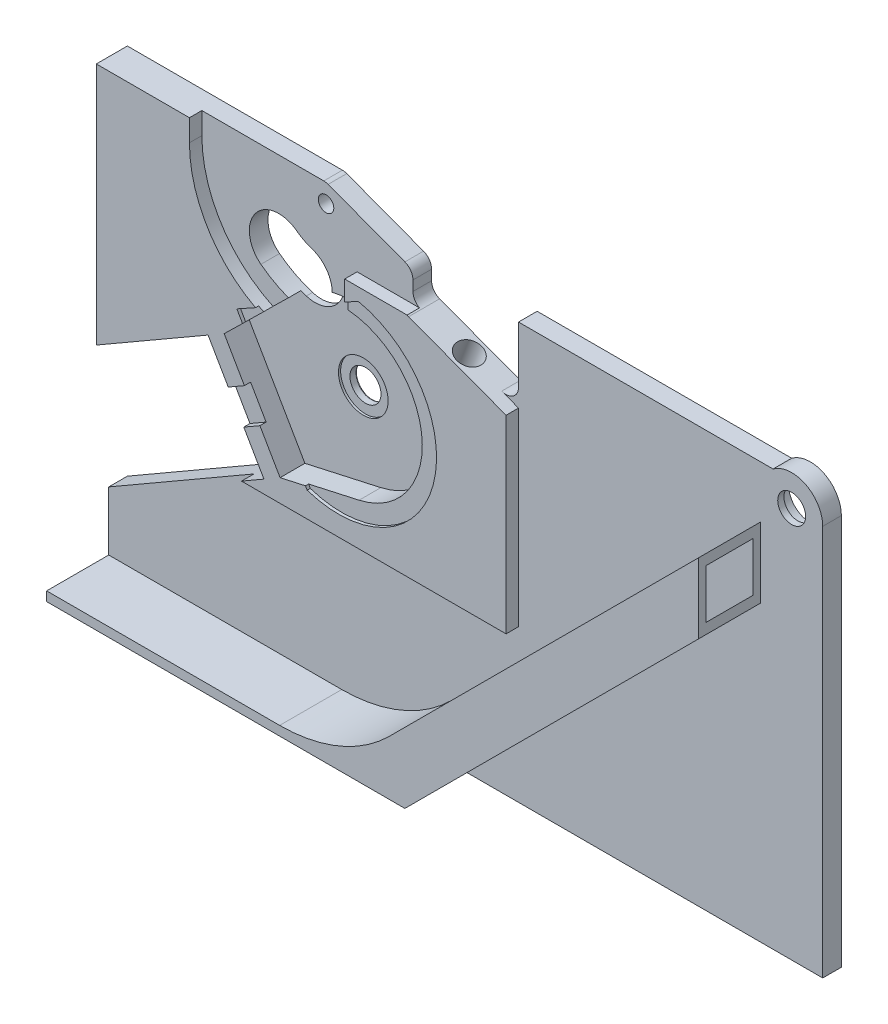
ISO-10303-21;
HEADER;
FILE_DESCRIPTION(('STEP AP214'),'2;1');
FILE_NAME('part.step','',(''),(''),'','','');
FILE_SCHEMA(('AUTOMOTIVE_DESIGN { 1 0 10303 214 1 1 1 1 }'));
ENDSEC;
DATA;
#1=APPLICATION_CONTEXT('core data for automotive mechanical design processes');
#2=APPLICATION_PROTOCOL_DEFINITION('international standard','automotive_design',2000,#1);
#3=PRODUCT_CONTEXT('',#1,'mechanical');
#4=PRODUCT('Part','Part','',(#3));
#5=PRODUCT_RELATED_PRODUCT_CATEGORY('part','',(#4));
#6=PRODUCT_DEFINITION_FORMATION('','',#4);
#7=PRODUCT_DEFINITION_CONTEXT('part definition',#1,'design');
#8=PRODUCT_DEFINITION('design','',#6,#7);
#9=PRODUCT_DEFINITION_SHAPE('','',#8);
#10=(LENGTH_UNIT() NAMED_UNIT(*) SI_UNIT(.MILLI.,.METRE.));
#11=(NAMED_UNIT(*) PLANE_ANGLE_UNIT() SI_UNIT($,.RADIAN.));
#12=(NAMED_UNIT(*) SI_UNIT($,.STERADIAN.) SOLID_ANGLE_UNIT());
#13=UNCERTAINTY_MEASURE_WITH_UNIT(LENGTH_MEASURE(1.E-05),#10,'distance_accuracy_value','');
#14=(GEOMETRIC_REPRESENTATION_CONTEXT(3) GLOBAL_UNCERTAINTY_ASSIGNED_CONTEXT((#13)) GLOBAL_UNIT_ASSIGNED_CONTEXT((#10,
#11,#12)) REPRESENTATION_CONTEXT('',''));
#15=CARTESIAN_POINT('',(0.,0.,0.));
#16=DIRECTION('',(0.,0.,1.));
#17=DIRECTION('',(1.,0.,0.));
#18=AXIS2_PLACEMENT_3D('',#15,#16,#17);
#19=CARTESIAN_POINT('',(0.,0.,5.));
#20=DIRECTION('',(0.,0.,1.));
#21=DIRECTION('',(1.,0.,0.));
#22=AXIS2_PLACEMENT_3D('',#19,#20,#21);
#23=PLANE('',#22);
#24=DIRECTION('',(-0.866025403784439,-0.499999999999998,0.));
#25=VECTOR('',#24,1.);
#26=CARTESIAN_POINT('',(21.25,36.547749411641,5.));
#27=LINE('',#26,#25);
#28=CARTESIAN_POINT('',(23.8480762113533,38.047749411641,5.));
#29=VERTEX_POINT('',#28);
#30=CARTESIAN_POINT('',(21.25,36.547749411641,5.));
#31=VERTEX_POINT('',#30);
#32=EDGE_CURVE('E415',#29,#31,#27,.T.);
#33=ORIENTED_EDGE('',*,*,#32,.F.);
#34=DIRECTION('',(0.5,-0.866025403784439,0.));
#35=VECTOR('',#34,1.);
#36=CARTESIAN_POINT('',(20.5980762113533,43.6769145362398,5.));
#37=LINE('',#36,#35);
#38=CARTESIAN_POINT('',(20.5980762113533,43.6769145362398,5.));
#39=VERTEX_POINT('',#38);
#40=EDGE_CURVE('E521',#39,#29,#37,.T.);
#41=ORIENTED_EDGE('',*,*,#40,.F.);
#42=DIRECTION('',(-0.71455604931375,-0.699578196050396,0.));
#43=VECTOR('',#42,1.);
#44=CARTESIAN_POINT('',(20.5980762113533,43.6769145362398,5.));
#45=LINE('',#44,#43);
#46=CARTESIAN_POINT('',(23.5489191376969,46.5659046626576,5.));
#47=VERTEX_POINT('',#46);
#48=EDGE_CURVE('E503',#47,#39,#45,.T.);
#49=ORIENTED_EDGE('',*,*,#48,.F.);
#50=DIRECTION('',(0.5,-0.866025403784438,0.));
#51=VECTOR('',#50,1.);
#52=CARTESIAN_POINT('',(22.6321786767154,48.1537457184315,5.));
#53=LINE('',#52,#51);
#54=CARTESIAN_POINT('',(22.6321786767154,48.1537457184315,5.));
#55=VERTEX_POINT('',#54);
#56=EDGE_CURVE('E439',#55,#47,#53,.T.);
#57=ORIENTED_EDGE('',*,*,#56,.F.);
#58=DIRECTION('',(-0.874842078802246,-0.484408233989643,0.));
#59=VECTOR('',#58,1.);
#60=CARTESIAN_POINT('',(42.178843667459,58.9769167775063,5.));
#61=LINE('',#60,#59);
#62=CARTESIAN_POINT('',(25.6457486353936,49.822387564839,5.));
#63=VERTEX_POINT('',#62);
#64=EDGE_CURVE('E448',#63,#55,#61,.T.);
#65=ORIENTED_EDGE('',*,*,#64,.F.);
#66=CARTESIAN_POINT('',(35.,67.5,5.));
#67=DIRECTION('',(0.,0.,1.));
#68=DIRECTION('',(1.,0.,0.));
#69=AXIS2_PLACEMENT_3D('',#66,#67,#68);
#70=CIRCLE('',#69,20.);
#71=CARTESIAN_POINT('',(15.,67.5,5.));
#72=VERTEX_POINT('',#71);
#73=EDGE_CURVE('E608',#72,#63,#70,.T.);
#74=ORIENTED_EDGE('',*,*,#73,.F.);
#75=DIRECTION('',(0.,-1.,0.));
#76=VECTOR('',#75,1.);
#77=CARTESIAN_POINT('',(15.,67.5,5.));
#78=LINE('',#77,#76);
#79=CARTESIAN_POINT('',(15.,71.,5.));
#80=VERTEX_POINT('',#79);
#81=EDGE_CURVE('E604',#80,#72,#78,.T.);
#82=ORIENTED_EDGE('',*,*,#81,.F.);
#83=DIRECTION('',(-1.,0.,0.));
#84=VECTOR('',#83,1.);
#85=CARTESIAN_POINT('',(21.,71.,5.));
#86=LINE('',#85,#84);
#87=CARTESIAN_POINT('',(0.,71.,5.));
#88=VERTEX_POINT('',#87);
#89=EDGE_CURVE('E638',#80,#88,#86,.T.);
#90=ORIENTED_EDGE('',*,*,#89,.T.);
#91=DIRECTION('',(0.,-1.,0.));
#92=VECTOR('',#91,1.);
#93=CARTESIAN_POINT('',(0.,71.,5.));
#94=LINE('',#93,#92);
#95=CARTESIAN_POINT('',(0.,31.7846096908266,5.));
#96=VERTEX_POINT('',#95);
#97=EDGE_CURVE('E640',#88,#96,#94,.T.);
#98=ORIENTED_EDGE('',*,*,#97,.T.);
#99=DIRECTION('',(0.866025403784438,0.500000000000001,0.));
#100=VECTOR('',#99,1.);
#101=CARTESIAN_POINT('',(0.,31.7846096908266,5.));
#102=LINE('',#101,#100);
#103=CARTESIAN_POINT('',(18.,42.1769145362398,5.));
#104=VERTEX_POINT('',#103);
#105=EDGE_CURVE('E643',#96,#104,#102,.T.);
#106=ORIENTED_EDGE('',*,*,#105,.T.);
#107=DIRECTION('',(0.500000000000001,-0.866025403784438,0.));
#108=VECTOR('',#107,1.);
#109=CARTESIAN_POINT('',(18.,42.1769145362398,5.));
#110=LINE('',#109,#108);
#111=EDGE_CURVE('E646',#104,#31,#110,.T.);
#112=ORIENTED_EDGE('',*,*,#111,.T.);
#113=EDGE_LOOP('',(#33,#41,#49,#57,#65,#74,#82,#90,#98,#106,#112));
#114=FACE_BOUND('',#113,.T.);
#115=ADVANCED_FACE('F35',(#114),#23,.T.);
#116=CARTESIAN_POINT('',(39.,43.5,1.));
#117=DIRECTION('',(0.,0.,1.));
#118=DIRECTION('',(1.,0.,0.));
#119=AXIS2_PLACEMENT_3D('',#116,#117,#118);
#120=CYLINDRICAL_SURFACE('',#119,13.);
#121=CARTESIAN_POINT('',(39.,43.5,4.5));
#122=DIRECTION('',(0.,0.,1.));
#123=DIRECTION('',(1.,0.,0.));
#124=AXIS2_PLACEMENT_3D('',#121,#122,#123);
#125=CIRCLE('',#124,13.);
#126=CARTESIAN_POINT('',(40.,56.4614813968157,4.5));
#127=VERTEX_POINT('',#126);
#128=CARTESIAN_POINT('',(41.8251469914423,30.8106917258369,4.5));
#129=VERTEX_POINT('',#128);
#130=EDGE_CURVE('E456',#127,#129,#125,.F.);
#131=ORIENTED_EDGE('',*,*,#130,.F.);
#132=DIRECTION('',(0.,0.,1.));
#133=VECTOR('',#132,1.);
#134=CARTESIAN_POINT('',(40.,56.4614813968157,1.));
#135=LINE('',#134,#133);
#136=CARTESIAN_POINT('',(40.,56.4614813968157,3.));
#137=VERTEX_POINT('',#136);
#138=EDGE_CURVE('E544',#137,#127,#135,.T.);
#139=ORIENTED_EDGE('',*,*,#138,.F.);
#140=CARTESIAN_POINT('',(39.,43.5,3.));
#141=DIRECTION('',(0.,0.,-1.));
#142=DIRECTION('',(-1.,0.,0.));
#143=AXIS2_PLACEMENT_3D('',#140,#141,#142);
#144=CIRCLE('',#143,13.);
#145=CARTESIAN_POINT('',(35.999435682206,56.1489767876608,3.));
#146=VERTEX_POINT('',#145);
#147=EDGE_CURVE('E541',#146,#137,#144,.T.);
#148=ORIENTED_EDGE('',*,*,#147,.F.);
#149=DIRECTION('',(0.,0.,1.));
#150=VECTOR('',#149,1.);
#151=CARTESIAN_POINT('',(35.999435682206,56.1489767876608,3.));
#152=LINE('',#151,#150);
#153=CARTESIAN_POINT('',(35.999435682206,56.1489767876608,1.));
#154=VERTEX_POINT('',#153);
#155=EDGE_CURVE('E910',#154,#146,#152,.T.);
#156=ORIENTED_EDGE('',*,*,#155,.F.);
#157=CARTESIAN_POINT('',(39.,43.5,1.));
#158=DIRECTION('',(0.,0.,1.));
#159=DIRECTION('',(1.,0.,0.));
#160=AXIS2_PLACEMENT_3D('',#157,#158,#159);
#161=CIRCLE('',#160,13.);
#162=CARTESIAN_POINT('',(41.8251469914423,30.8106917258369,1.));
#163=VERTEX_POINT('',#162);
#164=EDGE_CURVE('E515',#163,#154,#161,.T.);
#165=ORIENTED_EDGE('',*,*,#164,.F.);
#166=DIRECTION('',(0.,0.,1.));
#167=VECTOR('',#166,1.);
#168=CARTESIAN_POINT('',(41.8251469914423,30.8106917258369,1.));
#169=LINE('',#168,#167);
#170=EDGE_CURVE('E526',#163,#129,#169,.T.);
#171=ORIENTED_EDGE('',*,*,#170,.T.);
#172=EDGE_LOOP('',(#131,#139,#148,#156,#165,#171));
#173=FACE_BOUND('',#172,.T.);
#174=ADVANCED_FACE('F952',(#173),#120,.F.);
#175=CARTESIAN_POINT('',(60.,67.,3.));
#176=DIRECTION('',(0.,-1.,0.));
#177=DIRECTION('',(0.,0.,-1.));
#178=AXIS2_PLACEMENT_3D('',#175,#176,#177);
#179=PLANE('',#178);
#180=DIRECTION('',(-1.,0.,0.));
#181=VECTOR('',#180,1.);
#182=CARTESIAN_POINT('',(60.,67.,3.));
#183=LINE('',#182,#181);
#184=CARTESIAN_POINT('',(107.,67.,3.));
#185=VERTEX_POINT('',#184);
#186=CARTESIAN_POINT('',(66.,67.,3.));
#187=VERTEX_POINT('',#186);
#188=EDGE_CURVE('E862',#185,#187,#183,.T.);
#189=ORIENTED_EDGE('',*,*,#188,.F.);
#190=DIRECTION('',(0.,0.,-1.));
#191=VECTOR('',#190,1.);
#192=CARTESIAN_POINT('',(107.,67.,3.));
#193=LINE('',#192,#191);
#194=CARTESIAN_POINT('',(107.,67.,0.));
#195=VERTEX_POINT('',#194);
#196=EDGE_CURVE('E875',#185,#195,#193,.T.);
#197=ORIENTED_EDGE('',*,*,#196,.T.);
#198=DIRECTION('',(-1.,0.,0.));
#199=VECTOR('',#198,1.);
#200=CARTESIAN_POINT('',(60.,67.,0.));
#201=LINE('',#200,#199);
#202=CARTESIAN_POINT('',(66.,67.,0.));
#203=VERTEX_POINT('',#202);
#204=EDGE_CURVE('E859',#195,#203,#201,.T.);
#205=ORIENTED_EDGE('',*,*,#204,.T.);
#206=DIRECTION('',(0.,0.,1.));
#207=VECTOR('',#206,1.);
#208=CARTESIAN_POINT('',(66.,67.,3.));
#209=LINE('',#208,#207);
#210=EDGE_CURVE('E559',#203,#187,#209,.T.);
#211=ORIENTED_EDGE('',*,*,#210,.T.);
#212=EDGE_LOOP('',(#189,#197,#205,#211));
#213=FACE_BOUND('',#212,.T.);
#214=ADVANCED_FACE('F874',(#213),#179,.F.);
#215=CARTESIAN_POINT('',(0.,0.,0.));
#216=DIRECTION('',(0.,0.,-1.));
#217=DIRECTION('',(-1.,0.,0.));
#218=AXIS2_PLACEMENT_3D('',#215,#216,#217);
#219=PLANE('',#218);
#220=CARTESIAN_POINT('',(110.,63.,0.));
#221=DIRECTION('',(0.,0.,-1.));
#222=DIRECTION('',(-1.,0.,0.));
#223=AXIS2_PLACEMENT_3D('',#220,#221,#222);
#224=CIRCLE('',#223,5.00000000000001);
#225=CARTESIAN_POINT('',(115.,63.,0.));
#226=VERTEX_POINT('',#225);
#227=EDGE_CURVE('E487',#195,#226,#224,.T.);
#228=ORIENTED_EDGE('',*,*,#227,.T.);
#229=DIRECTION('',(0.,1.,0.));
#230=VECTOR('',#229,1.);
#231=CARTESIAN_POINT('',(115.,0.,0.));
#232=LINE('',#231,#230);
#233=CARTESIAN_POINT('',(115.,0.,0.));
#234=VERTEX_POINT('',#233);
#235=EDGE_CURVE('E820',#234,#226,#232,.T.);
#236=ORIENTED_EDGE('',*,*,#235,.F.);
#237=DIRECTION('',(1.,0.,0.));
#238=VECTOR('',#237,1.);
#239=CARTESIAN_POINT('',(0.,0.,0.));
#240=LINE('',#239,#238);
#241=CARTESIAN_POINT('',(0.,0.,0.));
#242=VERTEX_POINT('',#241);
#243=EDGE_CURVE('E818',#242,#234,#240,.T.);
#244=ORIENTED_EDGE('',*,*,#243,.F.);
#245=DIRECTION('',(0.,-1.,0.));
#246=VECTOR('',#245,1.);
#247=CARTESIAN_POINT('',(0.,67.,0.));
#248=LINE('',#247,#246);
#249=CARTESIAN_POINT('',(0.,11.,0.));
#250=VERTEX_POINT('',#249);
#251=EDGE_CURVE('E845',#250,#242,#248,.T.);
#252=ORIENTED_EDGE('',*,*,#251,.F.);
#253=DIRECTION('',(-0.866025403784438,-0.500000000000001,0.));
#254=VECTOR('',#253,1.);
#255=CARTESIAN_POINT('',(-4.76313972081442,8.24999999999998,0.));
#256=LINE('',#255,#254);
#257=CARTESIAN_POINT('',(27.,26.58845726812,0.));
#258=VERTEX_POINT('',#257);
#259=EDGE_CURVE('E763',#258,#250,#256,.T.);
#260=ORIENTED_EDGE('',*,*,#259,.F.);
#261=DIRECTION('',(0.500000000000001,-0.866025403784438,0.));
#262=VECTOR('',#261,1.);
#263=CARTESIAN_POINT('',(31.7631397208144,18.33845726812,0.));
#264=LINE('',#263,#262);
#265=CARTESIAN_POINT('',(18.,42.1769145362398,0.));
#266=VERTEX_POINT('',#265);
#267=EDGE_CURVE('E765',#266,#258,#264,.T.);
#268=ORIENTED_EDGE('',*,*,#267,.F.);
#269=DIRECTION('',(0.866025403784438,0.500000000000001,0.));
#270=VECTOR('',#269,1.);
#271=CARTESIAN_POINT('',(-13.7631397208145,23.8384572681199,0.));
#272=LINE('',#271,#270);
#273=CARTESIAN_POINT('',(0.,31.7846096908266,0.));
#274=VERTEX_POINT('',#273);
#275=EDGE_CURVE('E768',#274,#266,#272,.T.);
#276=ORIENTED_EDGE('',*,*,#275,.F.);
#277=CARTESIAN_POINT('',(0.,71.,0.));
#278=VERTEX_POINT('',#277);
#279=EDGE_CURVE('E775',#278,#274,#248,.T.);
#280=ORIENTED_EDGE('',*,*,#279,.F.);
#281=DIRECTION('',(-1.,0.,0.));
#282=VECTOR('',#281,1.);
#283=CARTESIAN_POINT('',(0.,71.,0.));
#284=LINE('',#283,#282);
#285=CARTESIAN_POINT('',(34.637330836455,71.,0.));
#286=VERTEX_POINT('',#285);
#287=EDGE_CURVE('E857',#286,#278,#284,.T.);
#288=ORIENTED_EDGE('',*,*,#287,.F.);
#289=CARTESIAN_POINT('',(34.637330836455,69.,0.));
#290=DIRECTION('',(0.,0.,-1.));
#291=DIRECTION('',(-1.,0.,0.));
#292=AXIS2_PLACEMENT_3D('',#289,#290,#291);
#293=CIRCLE('',#292,2.);
#294=CARTESIAN_POINT('',(35.3395777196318,70.8726583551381,0.));
#295=VERTEX_POINT('',#294);
#296=EDGE_CURVE('E1071',#286,#295,#293,.T.);
#297=ORIENTED_EDGE('',*,*,#296,.T.);
#298=DIRECTION('',(-0.936329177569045,0.351123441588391,0.));
#299=VECTOR('',#298,1.);
#300=CARTESIAN_POINT('',(49.,65.75,0.));
#301=LINE('',#300,#299);
#302=CARTESIAN_POINT('',(47.7022468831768,66.2366574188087,0.));
#303=VERTEX_POINT('',#302);
#304=EDGE_CURVE('E553',#303,#295,#301,.T.);
#305=ORIENTED_EDGE('',*,*,#304,.F.);
#306=CARTESIAN_POINT('',(47.,64.3639990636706,0.));
#307=DIRECTION('',(0.,0.,-1.));
#308=DIRECTION('',(-1.,0.,0.));
#309=AXIS2_PLACEMENT_3D('',#306,#307,#308);
#310=CIRCLE('',#309,2.);
#311=CARTESIAN_POINT('',(49.,64.3639990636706,0.));
#312=VERTEX_POINT('',#311);
#313=EDGE_CURVE('E1066',#303,#312,#310,.T.);
#314=ORIENTED_EDGE('',*,*,#313,.T.);
#315=DIRECTION('',(0.,1.,0.));
#316=VECTOR('',#315,1.);
#317=CARTESIAN_POINT('',(49.,61.375,0.));
#318=LINE('',#317,#316);
#319=CARTESIAN_POINT('',(49.,62.7610009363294,0.));
#320=VERTEX_POINT('',#319);
#321=EDGE_CURVE('E550',#320,#312,#318,.T.);
#322=ORIENTED_EDGE('',*,*,#321,.F.);
#323=CARTESIAN_POINT('',(51.,62.7610009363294,0.));
#324=DIRECTION('',(0.,0.,-1.));
#325=DIRECTION('',(-1.,0.,0.));
#326=AXIS2_PLACEMENT_3D('',#323,#324,#325);
#327=CIRCLE('',#326,2.);
#328=CARTESIAN_POINT('',(50.2977531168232,60.8883425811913,0.));
#329=VERTEX_POINT('',#328);
#330=EDGE_CURVE('E887',#320,#329,#327,.F.);
#331=ORIENTED_EDGE('',*,*,#330,.T.);
#332=DIRECTION('',(-0.936329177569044,0.351123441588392,0.));
#333=VECTOR('',#332,1.);
#334=CARTESIAN_POINT('',(66.,55.,0.));
#335=LINE('',#334,#333);
#336=CARTESIAN_POINT('',(63.2977531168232,56.0133425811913,0.));
#337=VERTEX_POINT('',#336);
#338=EDGE_CURVE('E547',#337,#329,#335,.T.);
#339=ORIENTED_EDGE('',*,*,#338,.F.);
#340=CARTESIAN_POINT('',(64.,57.8860009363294,0.));
#341=DIRECTION('',(0.,0.,-1.));
#342=DIRECTION('',(-1.,0.,0.));
#343=AXIS2_PLACEMENT_3D('',#340,#341,#342);
#344=CIRCLE('',#343,2.);
#345=CARTESIAN_POINT('',(66.,57.8860009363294,0.));
#346=VERTEX_POINT('',#345);
#347=EDGE_CURVE('E881',#337,#346,#344,.F.);
#348=ORIENTED_EDGE('',*,*,#347,.T.);
#349=DIRECTION('',(0.,-1.,0.));
#350=VECTOR('',#349,1.);
#351=CARTESIAN_POINT('',(66.,71.,0.));
#352=LINE('',#351,#350);
#353=EDGE_CURVE('E556',#203,#346,#352,.T.);
#354=ORIENTED_EDGE('',*,*,#353,.F.);
#355=ORIENTED_EDGE('',*,*,#204,.F.);
#356=EDGE_LOOP('',(#228,#236,#244,#252,#260,#268,#276,#280,#288,#297,#305,#314,#322,#331,#339,
#348,#354,#355));
#357=FACE_BOUND('',#356,.T.);
#358=CARTESIAN_POINT('',(110.,63.,0.));
#359=DIRECTION('',(0.,0.,-1.));
#360=DIRECTION('',(-1.,0.,0.));
#361=AXIS2_PLACEMENT_3D('',#358,#359,#360);
#362=CIRCLE('',#361,3.50000000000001);
#363=CARTESIAN_POINT('',(106.5,63.,0.));
#364=VERTEX_POINT('',#363);
#365=EDGE_CURVE('E483',#364,#364,#362,.T.);
#366=ORIENTED_EDGE('',*,*,#365,.F.);
#367=EDGE_LOOP('',(#366));
#368=FACE_BOUND('',#367,.T.);
#369=CARTESIAN_POINT('',(35.,68.,0.));
#370=DIRECTION('',(0.,0.,1.));
#371=DIRECTION('',(1.,0.,0.));
#372=AXIS2_PLACEMENT_3D('',#369,#370,#371);
#373=CIRCLE('',#372,1.25);
#374=CARTESIAN_POINT('',(36.25,68.,0.));
#375=VERTEX_POINT('',#374);
#376=EDGE_CURVE('E601',#375,#375,#373,.T.);
#377=ORIENTED_EDGE('',*,*,#376,.T.);
#378=EDGE_LOOP('',(#377));
#379=FACE_BOUND('',#378,.T.);
#380=CARTESIAN_POINT('',(27.3978223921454,58.0774551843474,0.));
#381=DIRECTION('',(0.,0.,-1.));
#382=DIRECTION('',(-1.,0.,0.));
#383=AXIS2_PLACEMENT_3D('',#380,#381,#382);
#384=CIRCLE('',#383,4.75);
#385=CARTESIAN_POINT('',(24.5089949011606,54.3068881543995,0.));
#386=VERTEX_POINT('',#385);
#387=CARTESIAN_POINT('',(30.2866498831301,61.8480222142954,0.));
#388=VERTEX_POINT('',#387);
#389=EDGE_CURVE('E596',#386,#388,#384,.T.);
#390=ORIENTED_EDGE('',*,*,#389,.F.);
#391=CARTESIAN_POINT('',(35.,68.,0.));
#392=DIRECTION('',(0.,0.,-1.));
#393=DIRECTION('',(-1.,0.,0.));
#394=AXIS2_PLACEMENT_3D('',#391,#392,#393);
#395=CIRCLE('',#394,17.25);
#396=CARTESIAN_POINT('',(29.825,51.5445487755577,0.));
#397=VERTEX_POINT('',#396);
#398=EDGE_CURVE('E581',#397,#386,#395,.T.);
#399=ORIENTED_EDGE('',*,*,#398,.F.);
#400=CARTESIAN_POINT('',(31.25,56.0757599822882,0.));
#401=DIRECTION('',(0.,0.,-1.));
#402=DIRECTION('',(-1.,0.,0.));
#403=AXIS2_PLACEMENT_3D('',#400,#401,#402);
#404=CIRCLE('',#403,4.75);
#405=CARTESIAN_POINT('',(32.675,60.6069711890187,0.));
#406=VERTEX_POINT('',#405);
#407=EDGE_CURVE('E591',#406,#397,#404,.T.);
#408=ORIENTED_EDGE('',*,*,#407,.F.);
#409=CARTESIAN_POINT('',(35.,68.,0.));
#410=DIRECTION('',(0.,0.,-1.));
#411=DIRECTION('',(-1.,0.,0.));
#412=AXIS2_PLACEMENT_3D('',#409,#410,#411);
#413=CIRCLE('',#412,7.75);
#414=EDGE_CURVE('E594',#388,#406,#413,.F.);
#415=ORIENTED_EDGE('',*,*,#414,.F.);
#416=EDGE_LOOP('',(#390,#399,#408,#415));
#417=FACE_BOUND('',#416,.T.);
#418=CARTESIAN_POINT('',(39.,43.5,0.));
#419=DIRECTION('',(0.,0.,-1.));
#420=DIRECTION('',(-1.,0.,0.));
#421=AXIS2_PLACEMENT_3D('',#418,#419,#420);
#422=CIRCLE('',#421,7.);
#423=CARTESIAN_POINT('',(32.,43.5,0.));
#424=VERTEX_POINT('',#423);
#425=EDGE_CURVE('E492',#424,#424,#422,.T.);
#426=ORIENTED_EDGE('',*,*,#425,.F.);
#427=EDGE_LOOP('',(#426));
#428=FACE_BOUND('',#427,.T.);
#429=ADVANCED_FACE('F878',(#357,#368,#379,#417,#428),#219,.T.);
#430=CARTESIAN_POINT('',(39.,43.5,0.));
#431=DIRECTION('',(0.,0.,1.));
#432=DIRECTION('',(1.,0.,0.));
#433=AXIS2_PLACEMENT_3D('',#430,#431,#432);
#434=CYLINDRICAL_SURFACE('',#433,2.5);
#435=CARTESIAN_POINT('',(39.,43.5,-0.3));
#436=DIRECTION('',(0.,0.,-1.));
#437=DIRECTION('',(-1.,0.,0.));
#438=AXIS2_PLACEMENT_3D('',#435,#436,#437);
#439=CIRCLE('',#438,2.5);
#440=CARTESIAN_POINT('',(36.5,43.5,-0.3));
#441=VERTEX_POINT('',#440);
#442=EDGE_CURVE('E913',#441,#441,#439,.T.);
#443=ORIENTED_EDGE('',*,*,#442,.T.);
#444=EDGE_LOOP('',(#443));
#445=FACE_BOUND('',#444,.T.);
#446=CARTESIAN_POINT('',(39.,43.5,0.65));
#447=DIRECTION('',(0.,0.,1.));
#448=DIRECTION('',(1.,0.,0.));
#449=AXIS2_PLACEMENT_3D('',#446,#447,#448);
#450=CIRCLE('',#449,2.5);
#451=CARTESIAN_POINT('',(41.5,43.5,0.65));
#452=VERTEX_POINT('',#451);
#453=EDGE_CURVE('E496',#452,#452,#450,.T.);
#454=ORIENTED_EDGE('',*,*,#453,.T.);
#455=EDGE_LOOP('',(#454));
#456=FACE_BOUND('',#455,.T.);
#457=ADVANCED_FACE('F1176',(#445,#456),#434,.F.);
#458=CARTESIAN_POINT('',(0.,0.,3.));
#459=DIRECTION('',(0.,0.,-1.));
#460=DIRECTION('',(-1.,0.,0.));
#461=AXIS2_PLACEMENT_3D('',#458,#459,#460);
#462=PLANE('',#461);
#463=CARTESIAN_POINT('',(110.,63.,3.));
#464=DIRECTION('',(0.,0.,-1.));
#465=DIRECTION('',(-1.,0.,0.));
#466=AXIS2_PLACEMENT_3D('',#463,#464,#465);
#467=CIRCLE('',#466,2.25);
#468=CARTESIAN_POINT('',(107.75,63.,3.));
#469=VERTEX_POINT('',#468);
#470=EDGE_CURVE('E480',#469,#469,#467,.T.);
#471=ORIENTED_EDGE('',*,*,#470,.T.);
#472=EDGE_LOOP('',(#471));
#473=FACE_BOUND('',#472,.T.);
#474=DIRECTION('',(0.,1.,0.));
#475=VECTOR('',#474,1.);
#476=CARTESIAN_POINT('',(115.,0.,3.));
#477=LINE('',#476,#475);
#478=CARTESIAN_POINT('',(115.,0.,3.));
#479=VERTEX_POINT('',#478);
#480=CARTESIAN_POINT('',(115.,63.,3.));
#481=VERTEX_POINT('',#480);
#482=EDGE_CURVE('E784',#479,#481,#477,.T.);
#483=ORIENTED_EDGE('',*,*,#482,.T.);
#484=CARTESIAN_POINT('',(110.,63.,3.));
#485=DIRECTION('',(0.,0.,-1.));
#486=DIRECTION('',(-1.,0.,0.));
#487=AXIS2_PLACEMENT_3D('',#484,#485,#486);
#488=CIRCLE('',#487,5.00000000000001);
#489=EDGE_CURVE('E490',#185,#481,#488,.T.);
#490=ORIENTED_EDGE('',*,*,#489,.F.);
#491=ORIENTED_EDGE('',*,*,#188,.T.);
#492=DIRECTION('',(0.,-1.,0.));
#493=VECTOR('',#492,1.);
#494=CARTESIAN_POINT('',(66.,0.,3.));
#495=LINE('',#494,#493);
#496=CARTESIAN_POINT('',(66.,57.8860009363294,3.));
#497=VERTEX_POINT('',#496);
#498=EDGE_CURVE('E562',#187,#497,#495,.T.);
#499=ORIENTED_EDGE('',*,*,#498,.T.);
#500=CARTESIAN_POINT('',(64.,57.8860009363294,3.));
#501=DIRECTION('',(0.,0.,-1.));
#502=DIRECTION('',(-1.,0.,0.));
#503=AXIS2_PLACEMENT_3D('',#500,#501,#502);
#504=CIRCLE('',#503,2.);
#505=CARTESIAN_POINT('',(63.2977531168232,56.0133425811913,3.));
#506=VERTEX_POINT('',#505);
#507=EDGE_CURVE('E886',#497,#506,#504,.T.);
#508=ORIENTED_EDGE('',*,*,#507,.T.);
#509=DIRECTION('',(-0.936329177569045,0.351123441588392,0.));
#510=VECTOR('',#509,1.);
#511=CARTESIAN_POINT('',(26.2191780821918,69.9178082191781,3.));
#512=LINE('',#511,#510);
#513=CARTESIAN_POINT('',(66.,55.,3.));
#514=VERTEX_POINT('',#513);
#515=EDGE_CURVE('E1045',#514,#506,#512,.T.);
#516=ORIENTED_EDGE('',*,*,#515,.F.);
#517=DIRECTION('',(0.,1.,0.));
#518=VECTOR('',#517,1.);
#519=CARTESIAN_POINT('',(66.,24.5,3.));
#520=LINE('',#519,#518);
#521=CARTESIAN_POINT('',(66.,24.5,3.));
#522=VERTEX_POINT('',#521);
#523=EDGE_CURVE('E627',#522,#514,#520,.T.);
#524=ORIENTED_EDGE('',*,*,#523,.F.);
#525=DIRECTION('',(1.,0.,0.));
#526=VECTOR('',#525,1.);
#527=CARTESIAN_POINT('',(23.3826859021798,24.5,3.));
#528=LINE('',#527,#526);
#529=CARTESIAN_POINT('',(23.3826859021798,24.5,3.));
#530=VERTEX_POINT('',#529);
#531=EDGE_CURVE('E632',#530,#522,#528,.T.);
#532=ORIENTED_EDGE('',*,*,#531,.F.);
#533=DIRECTION('',(0.866025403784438,0.500000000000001,0.));
#534=VECTOR('',#533,1.);
#535=CARTESIAN_POINT('',(0.,11.,3.));
#536=LINE('',#535,#534);
#537=CARTESIAN_POINT('',(0.,11.,3.));
#538=VERTEX_POINT('',#537);
#539=EDGE_CURVE('E667',#538,#530,#536,.T.);
#540=ORIENTED_EDGE('',*,*,#539,.F.);
#541=DIRECTION('',(0.,-1.,0.));
#542=VECTOR('',#541,1.);
#543=CARTESIAN_POINT('',(0.,0.,3.));
#544=LINE('',#543,#542);
#545=CARTESIAN_POINT('',(0.,1.50000000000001,3.));
#546=VERTEX_POINT('',#545);
#547=EDGE_CURVE('E771',#538,#546,#544,.T.);
#548=ORIENTED_EDGE('',*,*,#547,.T.);
#549=DIRECTION('',(-1.,0.,0.));
#550=VECTOR('',#549,1.);
#551=CARTESIAN_POINT('',(0.,1.5,3.));
#552=LINE('',#551,#550);
#553=CARTESIAN_POINT('',(37.5309524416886,1.50000000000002,3.));
#554=VERTEX_POINT('',#553);
#555=EDGE_CURVE('E712',#554,#546,#552,.T.);
#556=ORIENTED_EDGE('',*,*,#555,.F.);
#557=CARTESIAN_POINT('',(37.5309524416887,26.5,3.));
#558=DIRECTION('',(0.,0.,-1.));
#559=DIRECTION('',(-1.,0.,0.));
#560=AXIS2_PLACEMENT_3D('',#557,#558,#559);
#561=CIRCLE('',#560,25.);
#562=CARTESIAN_POINT('',(55.2086219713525,8.82233047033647,3.));
#563=VERTEX_POINT('',#562);
#564=EDGE_CURVE('E732',#563,#554,#561,.T.);
#565=ORIENTED_EDGE('',*,*,#564,.F.);
#566=DIRECTION('',(-0.707106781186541,-0.707106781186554,0.));
#567=VECTOR('',#566,1.);
#568=CARTESIAN_POINT('',(105.,58.6137084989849,3.));
#569=LINE('',#568,#567);
#570=CARTESIAN_POINT('',(105.,58.6137084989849,3.));
#571=VERTEX_POINT('',#570);
#572=EDGE_CURVE('E729',#571,#563,#569,.T.);
#573=ORIENTED_EDGE('',*,*,#572,.F.);
#574=DIRECTION('',(0.,1.,0.));
#575=VECTOR('',#574,1.);
#576=CARTESIAN_POINT('',(105.,58.6137084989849,3.));
#577=LINE('',#576,#575);
#578=CARTESIAN_POINT('',(105.,47.3,3.));
#579=VERTEX_POINT('',#578);
#580=EDGE_CURVE('E726',#579,#571,#577,.T.);
#581=ORIENTED_EDGE('',*,*,#580,.F.);
#582=DIRECTION('',(0.707106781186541,0.707106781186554,0.));
#583=VECTOR('',#582,1.);
#584=CARTESIAN_POINT('',(105.,47.3,3.));
#585=LINE('',#584,#583);
#586=CARTESIAN_POINT('',(57.7000000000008,0.,3.));
#587=VERTEX_POINT('',#586);
#588=EDGE_CURVE('E707',#587,#579,#585,.T.);
#589=ORIENTED_EDGE('',*,*,#588,.F.);
#590=DIRECTION('',(1.,0.,0.));
#591=VECTOR('',#590,1.);
#592=CARTESIAN_POINT('',(0.,0.,3.));
#593=LINE('',#592,#591);
#594=EDGE_CURVE('E774',#587,#479,#593,.T.);
#595=ORIENTED_EDGE('',*,*,#594,.T.);
#596=EDGE_LOOP('',(#483,#490,#491,#499,#508,#516,#524,#532,#540,#548,#556,#565,#573,#581,#589,#595));
#597=FACE_BOUND('',#596,.T.);
#598=ADVANCED_FACE('F811',(#473,#597),#462,.F.);
#599=CARTESIAN_POINT('',(35.,67.5,3.));
#600=DIRECTION('',(0.,0.,-1.));
#601=DIRECTION('',(-1.,0.,0.));
#602=AXIS2_PLACEMENT_3D('',#599,#600,#601);
#603=CIRCLE('',#602,20.);
#604=CARTESIAN_POINT('',(15.,67.5,3.));
#605=VERTEX_POINT('',#604);
#606=CARTESIAN_POINT('',(26.4593118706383,49.415292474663,3.));
#607=VERTEX_POINT('',#606);
#608=EDGE_CURVE('E619',#605,#607,#603,.F.);
#609=ORIENTED_EDGE('',*,*,#608,.T.);
#610=DIRECTION('',(0.71455604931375,0.699578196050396,0.));
#611=VECTOR('',#610,1.);
#612=CARTESIAN_POINT('',(-11.752660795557,12.0042833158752,3.));
#613=LINE('',#612,#611);
#614=CARTESIAN_POINT('',(28.9440687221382,51.8479661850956,3.));
#615=VERTEX_POINT('',#614);
#616=EDGE_CURVE('E536',#607,#615,#613,.T.);
#617=ORIENTED_EDGE('',*,*,#616,.T.);
#618=CARTESIAN_POINT('',(35.,68.,3.));
#619=DIRECTION('',(0.,0.,1.));
#620=DIRECTION('',(1.,0.,0.));
#621=AXIS2_PLACEMENT_3D('',#618,#619,#620);
#622=CIRCLE('',#621,17.25);
#623=CARTESIAN_POINT('',(24.5089949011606,54.3068881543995,3.));
#624=VERTEX_POINT('',#623);
#625=EDGE_CURVE('E570',#624,#615,#622,.T.);
#626=ORIENTED_EDGE('',*,*,#625,.F.);
#627=CARTESIAN_POINT('',(27.3978223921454,58.0774551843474,3.));
#628=DIRECTION('',(0.,0.,1.));
#629=DIRECTION('',(1.,0.,0.));
#630=AXIS2_PLACEMENT_3D('',#627,#628,#629);
#631=CIRCLE('',#630,4.75);
#632=CARTESIAN_POINT('',(30.2866498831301,61.8480222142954,3.));
#633=VERTEX_POINT('',#632);
#634=EDGE_CURVE('E568',#633,#624,#631,.T.);
#635=ORIENTED_EDGE('',*,*,#634,.F.);
#636=CARTESIAN_POINT('',(35.,68.,3.));
#637=DIRECTION('',(0.,0.,-1.));
#638=DIRECTION('',(1.,0.,0.));
#639=AXIS2_PLACEMENT_3D('',#636,#637,#638);
#640=CIRCLE('',#639,7.75);
#641=CARTESIAN_POINT('',(32.675,60.6069711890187,3.));
#642=VERTEX_POINT('',#641);
#643=EDGE_CURVE('E575',#642,#633,#640,.T.);
#644=ORIENTED_EDGE('',*,*,#643,.F.);
#645=CARTESIAN_POINT('',(31.25,56.0757599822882,3.));
#646=DIRECTION('',(0.,0.,1.));
#647=DIRECTION('',(1.,0.,0.));
#648=AXIS2_PLACEMENT_3D('',#645,#646,#647);
#649=CIRCLE('',#648,4.75);
#650=EDGE_CURVE('E573',#146,#642,#649,.T.);
#651=ORIENTED_EDGE('',*,*,#650,.F.);
#652=ORIENTED_EDGE('',*,*,#147,.T.);
#653=DIRECTION('',(0.,1.,0.));
#654=VECTOR('',#653,1.);
#655=CARTESIAN_POINT('',(40.,71.,3.));
#656=LINE('',#655,#654);
#657=CARTESIAN_POINT('',(40.,61.,3.));
#658=VERTEX_POINT('',#657);
#659=EDGE_CURVE('E616',#137,#658,#656,.T.);
#660=ORIENTED_EDGE('',*,*,#659,.T.);
#661=DIRECTION('',(-1.,0.,0.));
#662=VECTOR('',#661,1.);
#663=CARTESIAN_POINT('',(50.,61.,3.));
#664=LINE('',#663,#662);
#665=CARTESIAN_POINT('',(50.0519094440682,61.,3.));
#666=VERTEX_POINT('',#665);
#667=EDGE_CURVE('E656',#666,#658,#664,.T.);
#668=ORIENTED_EDGE('',*,*,#667,.F.);
#669=CARTESIAN_POINT('',(51.,62.7610009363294,3.));
#670=DIRECTION('',(0.,0.,-1.));
#671=DIRECTION('',(-1.,0.,0.));
#672=AXIS2_PLACEMENT_3D('',#669,#670,#671);
#673=CIRCLE('',#672,2.);
#674=CARTESIAN_POINT('',(49.,62.7610009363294,3.));
#675=VERTEX_POINT('',#674);
#676=EDGE_CURVE('E901',#666,#675,#673,.T.);
#677=ORIENTED_EDGE('',*,*,#676,.T.);
#678=DIRECTION('',(0.,1.,0.));
#679=VECTOR('',#678,1.);
#680=CARTESIAN_POINT('',(49.,0.,3.));
#681=LINE('',#680,#679);
#682=CARTESIAN_POINT('',(49.,64.3639990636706,3.));
#683=VERTEX_POINT('',#682);
#684=EDGE_CURVE('E770',#675,#683,#681,.T.);
#685=ORIENTED_EDGE('',*,*,#684,.T.);
#686=CARTESIAN_POINT('',(47.,64.3639990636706,3.));
#687=DIRECTION('',(0.,0.,-1.));
#688=DIRECTION('',(-1.,0.,0.));
#689=AXIS2_PLACEMENT_3D('',#686,#687,#688);
#690=CIRCLE('',#689,2.);
#691=CARTESIAN_POINT('',(47.7022468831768,66.2366574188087,3.));
#692=VERTEX_POINT('',#691);
#693=EDGE_CURVE('E1080',#683,#692,#690,.F.);
#694=ORIENTED_EDGE('',*,*,#693,.T.);
#695=DIRECTION('',(-0.936329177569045,0.351123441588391,0.));
#696=VECTOR('',#695,1.);
#697=CARTESIAN_POINT('',(27.6575342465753,73.7534246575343,3.));
#698=LINE('',#697,#696);
#699=CARTESIAN_POINT('',(35.3395777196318,70.8726583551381,3.));
#700=VERTEX_POINT('',#699);
#701=EDGE_CURVE('E565',#692,#700,#698,.T.);
#702=ORIENTED_EDGE('',*,*,#701,.T.);
#703=CARTESIAN_POINT('',(34.637330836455,69.,3.));
#704=DIRECTION('',(0.,0.,-1.));
#705=DIRECTION('',(-1.,0.,0.));
#706=AXIS2_PLACEMENT_3D('',#703,#704,#705);
#707=CIRCLE('',#706,2.);
#708=CARTESIAN_POINT('',(34.637330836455,71.,3.));
#709=VERTEX_POINT('',#708);
#710=EDGE_CURVE('E1082',#700,#709,#707,.F.);
#711=ORIENTED_EDGE('',*,*,#710,.T.);
#712=DIRECTION('',(-1.,0.,0.));
#713=VECTOR('',#712,1.);
#714=CARTESIAN_POINT('',(0.,71.,3.));
#715=LINE('',#714,#713);
#716=CARTESIAN_POINT('',(15.,71.,3.));
#717=VERTEX_POINT('',#716);
#718=EDGE_CURVE('E852',#709,#717,#715,.T.);
#719=ORIENTED_EDGE('',*,*,#718,.T.);
#720=DIRECTION('',(0.,-1.,0.));
#721=VECTOR('',#720,1.);
#722=CARTESIAN_POINT('',(15.,67.5,3.));
#723=LINE('',#722,#721);
#724=EDGE_CURVE('E607',#717,#605,#723,.T.);
#725=ORIENTED_EDGE('',*,*,#724,.T.);
#726=EDGE_LOOP('',(#609,#617,#626,#635,#644,#651,#652,#660,#668,#677,#685,#694,#702,#711,#719,#725));
#727=FACE_BOUND('',#726,.T.);
#728=CARTESIAN_POINT('',(35.,68.,3.));
#729=DIRECTION('',(0.,0.,1.));
#730=DIRECTION('',(1.,0.,0.));
#731=AXIS2_PLACEMENT_3D('',#728,#729,#730);
#732=CIRCLE('',#731,1.24999999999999);
#733=CARTESIAN_POINT('',(36.25,68.,3.));
#734=VERTEX_POINT('',#733);
#735=EDGE_CURVE('E598',#734,#734,#732,.T.);
#736=ORIENTED_EDGE('',*,*,#735,.F.);
#737=EDGE_LOOP('',(#736));
#738=FACE_BOUND('',#737,.T.);
#739=ADVANCED_FACE('F959',(#727,#738),#462,.F.);
#740=CARTESIAN_POINT('',(0.,67.,3.));
#741=DIRECTION('',(1.,0.,0.));
#742=DIRECTION('',(0.,0.,-1.));
#743=AXIS2_PLACEMENT_3D('',#740,#741,#742);
#744=PLANE('',#743);
#745=ORIENTED_EDGE('',*,*,#279,.T.);
#746=DIRECTION('',(0.,0.,1.));
#747=VECTOR('',#746,1.);
#748=CARTESIAN_POINT('',(0.,31.7846096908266,-7.));
#749=LINE('',#748,#747);
#750=EDGE_CURVE('E671',#274,#96,#749,.T.);
#751=ORIENTED_EDGE('',*,*,#750,.T.);
#752=ORIENTED_EDGE('',*,*,#97,.F.);
#753=DIRECTION('',(0.,0.,-1.));
#754=VECTOR('',#753,1.);
#755=CARTESIAN_POINT('',(0.,71.,3.));
#756=LINE('',#755,#754);
#757=EDGE_CURVE('E847',#88,#278,#756,.T.);
#758=ORIENTED_EDGE('',*,*,#757,.T.);
#759=EDGE_LOOP('',(#745,#751,#752,#758));
#760=FACE_BOUND('',#759,.T.);
#761=ADVANCED_FACE('F1100',(#760),#744,.F.);
#762=CARTESIAN_POINT('',(0.,0.,3.));
#763=DIRECTION('',(0.,1.,0.));
#764=DIRECTION('',(0.,0.,1.));
#765=AXIS2_PLACEMENT_3D('',#762,#763,#764);
#766=PLANE('',#765);
#767=ORIENTED_EDGE('',*,*,#243,.T.);
#768=DIRECTION('',(0.,0.,-1.));
#769=VECTOR('',#768,1.);
#770=CARTESIAN_POINT('',(115.,0.,3.));
#771=LINE('',#770,#769);
#772=EDGE_CURVE('E807',#479,#234,#771,.T.);
#773=ORIENTED_EDGE('',*,*,#772,.F.);
#774=ORIENTED_EDGE('',*,*,#594,.F.);
#775=DIRECTION('',(0.,0.,-1.));
#776=VECTOR('',#775,1.);
#777=CARTESIAN_POINT('',(57.7000000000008,0.,13.));
#778=LINE('',#777,#776);
#779=CARTESIAN_POINT('',(57.7000000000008,0.,13.));
#780=VERTEX_POINT('',#779);
#781=EDGE_CURVE('E725',#780,#587,#778,.T.);
#782=ORIENTED_EDGE('',*,*,#781,.F.);
#783=DIRECTION('',(1.,0.,0.));
#784=VECTOR('',#783,1.);
#785=CARTESIAN_POINT('',(0.,0.,13.));
#786=LINE('',#785,#784);
#787=CARTESIAN_POINT('',(0.,0.,13.));
#788=VERTEX_POINT('',#787);
#789=EDGE_CURVE('E723',#788,#780,#786,.T.);
#790=ORIENTED_EDGE('',*,*,#789,.F.);
#791=DIRECTION('',(0.,0.,-1.));
#792=VECTOR('',#791,1.);
#793=CARTESIAN_POINT('',(0.,0.,3.));
#794=LINE('',#793,#792);
#795=EDGE_CURVE('E754',#788,#242,#794,.T.);
#796=ORIENTED_EDGE('',*,*,#795,.T.);
#797=EDGE_LOOP('',(#767,#773,#774,#782,#790,#796));
#798=FACE_BOUND('',#797,.T.);
#799=DIRECTION('',(-1.,0.,0.));
#800=VECTOR('',#799,1.);
#801=CARTESIAN_POINT('',(0.,0.,4.2));
#802=LINE('',#801,#800);
#803=CARTESIAN_POINT('',(56.0029437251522,0.,4.2));
#804=VERTEX_POINT('',#803);
#805=CARTESIAN_POINT('',(37.7280087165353,0.,4.2));
#806=VERTEX_POINT('',#805);
#807=EDGE_CURVE('E702',#804,#806,#802,.T.);
#808=ORIENTED_EDGE('',*,*,#807,.T.);
#809=DIRECTION('',(0.,0.,-1.));
#810=VECTOR('',#809,1.);
#811=CARTESIAN_POINT('',(37.7280087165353,0.,30.9341716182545));
#812=LINE('',#811,#810);
#813=CARTESIAN_POINT('',(37.7280087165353,0.,11.8));
#814=VERTEX_POINT('',#813);
#815=EDGE_CURVE('E682',#814,#806,#812,.T.);
#816=ORIENTED_EDGE('',*,*,#815,.F.);
#817=DIRECTION('',(1.,0.,0.));
#818=VECTOR('',#817,1.);
#819=CARTESIAN_POINT('',(0.,0.,11.8));
#820=LINE('',#819,#818);
#821=CARTESIAN_POINT('',(56.0029437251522,0.,11.8));
#822=VERTEX_POINT('',#821);
#823=EDGE_CURVE('E704',#814,#822,#820,.T.);
#824=ORIENTED_EDGE('',*,*,#823,.T.);
#825=DIRECTION('',(0.,0.,-1.));
#826=VECTOR('',#825,1.);
#827=CARTESIAN_POINT('',(56.0029437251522,0.,3.));
#828=LINE('',#827,#826);
#829=EDGE_CURVE('E693',#822,#804,#828,.T.);
#830=ORIENTED_EDGE('',*,*,#829,.T.);
#831=EDGE_LOOP('',(#808,#816,#824,#830));
#832=FACE_BOUND('',#831,.T.);
#833=ADVANCED_FACE('F802',(#798,#832),#766,.F.);
#834=CARTESIAN_POINT('',(115.,0.,3.));
#835=DIRECTION('',(-1.,0.,0.));
#836=DIRECTION('',(0.,0.,1.));
#837=AXIS2_PLACEMENT_3D('',#834,#835,#836);
#838=PLANE('',#837);
#839=ORIENTED_EDGE('',*,*,#235,.T.);
#840=DIRECTION('',(0.,0.,-1.));
#841=VECTOR('',#840,1.);
#842=CARTESIAN_POINT('',(115.,63.,13.000025));
#843=LINE('',#842,#841);
#844=EDGE_CURVE('E474',#481,#226,#843,.T.);
#845=ORIENTED_EDGE('',*,*,#844,.F.);
#846=ORIENTED_EDGE('',*,*,#482,.F.);
#847=ORIENTED_EDGE('',*,*,#772,.T.);
#848=EDGE_LOOP('',(#839,#845,#846,#847));
#849=FACE_BOUND('',#848,.T.);
#850=ADVANCED_FACE('F1107',(#849),#838,.F.);
#851=CARTESIAN_POINT('',(0.,71.,3.));
#852=DIRECTION('',(0.,-1.,0.));
#853=DIRECTION('',(0.,0.,-1.));
#854=AXIS2_PLACEMENT_3D('',#851,#852,#853);
#855=PLANE('',#854);
#856=ORIENTED_EDGE('',*,*,#718,.F.);
#857=DIRECTION('',(0.,0.,-1.));
#858=VECTOR('',#857,1.);
#859=CARTESIAN_POINT('',(34.637330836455,71.,3.));
#860=LINE('',#859,#858);
#861=EDGE_CURVE('E1064',#709,#286,#860,.T.);
#862=ORIENTED_EDGE('',*,*,#861,.T.);
#863=ORIENTED_EDGE('',*,*,#287,.T.);
#864=ORIENTED_EDGE('',*,*,#757,.F.);
#865=ORIENTED_EDGE('',*,*,#89,.F.);
#866=DIRECTION('',(0.,0.,1.));
#867=VECTOR('',#866,1.);
#868=CARTESIAN_POINT('',(15.,71.,-31.3110769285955));
#869=LINE('',#868,#867);
#870=EDGE_CURVE('E618',#717,#80,#869,.T.);
#871=ORIENTED_EDGE('',*,*,#870,.F.);
#872=EDGE_LOOP('',(#856,#862,#863,#864,#865,#871));
#873=FACE_BOUND('',#872,.T.);
#874=ADVANCED_FACE('F1097',(#873),#855,.F.);
#875=ORIENTED_EDGE('',*,*,#547,.F.);
#876=DIRECTION('',(0.,0.,1.));
#877=VECTOR('',#876,1.);
#878=CARTESIAN_POINT('',(0.,11.,-7.));
#879=LINE('',#878,#877);
#880=EDGE_CURVE('E670',#250,#538,#879,.T.);
#881=ORIENTED_EDGE('',*,*,#880,.F.);
#882=ORIENTED_EDGE('',*,*,#251,.T.);
#883=ORIENTED_EDGE('',*,*,#795,.F.);
#884=DIRECTION('',(0.,-1.,0.));
#885=VECTOR('',#884,1.);
#886=CARTESIAN_POINT('',(0.,0.,13.));
#887=LINE('',#886,#885);
#888=CARTESIAN_POINT('',(0.,1.5,13.));
#889=VERTEX_POINT('',#888);
#890=EDGE_CURVE('E720',#889,#788,#887,.T.);
#891=ORIENTED_EDGE('',*,*,#890,.F.);
#892=DIRECTION('',(0.,0.,-1.));
#893=VECTOR('',#892,1.);
#894=CARTESIAN_POINT('',(0.,1.5,13.));
#895=LINE('',#894,#893);
#896=EDGE_CURVE('E745',#889,#546,#895,.T.);
#897=ORIENTED_EDGE('',*,*,#896,.T.);
#898=EDGE_LOOP('',(#875,#881,#882,#883,#891,#897));
#899=FACE_BOUND('',#898,.T.);
#900=ADVANCED_FACE('F842',(#899),#744,.F.);
#901=CARTESIAN_POINT('',(105.,47.3,13.));
#902=DIRECTION('',(-0.707106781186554,0.707106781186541,0.));
#903=DIRECTION('',(-0.707106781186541,-0.707106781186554,0.));
#904=AXIS2_PLACEMENT_3D('',#901,#902,#903);
#905=PLANE('',#904);
#906=ORIENTED_EDGE('',*,*,#588,.T.);
#907=DIRECTION('',(0.,0.,-1.));
#908=VECTOR('',#907,1.);
#909=CARTESIAN_POINT('',(105.,47.3,13.));
#910=LINE('',#909,#908);
#911=CARTESIAN_POINT('',(105.,47.3,13.));
#912=VERTEX_POINT('',#911);
#913=EDGE_CURVE('E780',#912,#579,#910,.T.);
#914=ORIENTED_EDGE('',*,*,#913,.F.);
#915=DIRECTION('',(0.707106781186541,0.707106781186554,0.));
#916=VECTOR('',#915,1.);
#917=CARTESIAN_POINT('',(105.,47.3,13.));
#918=LINE('',#917,#916);
#919=EDGE_CURVE('E708',#780,#912,#918,.T.);
#920=ORIENTED_EDGE('',*,*,#919,.F.);
#921=ORIENTED_EDGE('',*,*,#781,.T.);
#922=EDGE_LOOP('',(#906,#914,#920,#921));
#923=FACE_BOUND('',#922,.T.);
#924=ADVANCED_FACE('F797',(#923),#905,.F.);
#925=CARTESIAN_POINT('',(105.,58.6137084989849,13.));
#926=DIRECTION('',(-1.,0.,0.));
#927=DIRECTION('',(0.,0.,1.));
#928=AXIS2_PLACEMENT_3D('',#925,#926,#927);
#929=PLANE('',#928);
#930=DIRECTION('',(0.,0.,1.));
#931=VECTOR('',#930,1.);
#932=CARTESIAN_POINT('',(105.,48.9970562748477,13.));
#933=LINE('',#932,#931);
#934=CARTESIAN_POINT('',(105.,48.9970562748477,4.2));
#935=VERTEX_POINT('',#934);
#936=CARTESIAN_POINT('',(105.,48.9970562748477,11.8));
#937=VERTEX_POINT('',#936);
#938=EDGE_CURVE('E750',#935,#937,#933,.T.);
#939=ORIENTED_EDGE('',*,*,#938,.T.);
#940=DIRECTION('',(0.,1.,0.));
#941=VECTOR('',#940,1.);
#942=CARTESIAN_POINT('',(105.,58.6137084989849,11.8));
#943=LINE('',#942,#941);
#944=CARTESIAN_POINT('',(105.,56.9166522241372,11.8));
#945=VERTEX_POINT('',#944);
#946=EDGE_CURVE('E760',#937,#945,#943,.T.);
#947=ORIENTED_EDGE('',*,*,#946,.T.);
#948=DIRECTION('',(0.,0.,-1.));
#949=VECTOR('',#948,1.);
#950=CARTESIAN_POINT('',(105.,56.9166522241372,13.));
#951=LINE('',#950,#949);
#952=CARTESIAN_POINT('',(105.,56.9166522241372,4.2));
#953=VERTEX_POINT('',#952);
#954=EDGE_CURVE('E757',#945,#953,#951,.T.);
#955=ORIENTED_EDGE('',*,*,#954,.T.);
#956=DIRECTION('',(0.,-1.,0.));
#957=VECTOR('',#956,1.);
#958=CARTESIAN_POINT('',(105.,58.6137084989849,4.2));
#959=LINE('',#958,#957);
#960=EDGE_CURVE('E753',#953,#935,#959,.T.);
#961=ORIENTED_EDGE('',*,*,#960,.T.);
#962=EDGE_LOOP('',(#939,#947,#955,#961));
#963=FACE_BOUND('',#962,.T.);
#964=ORIENTED_EDGE('',*,*,#580,.T.);
#965=DIRECTION('',(0.,0.,-1.));
#966=VECTOR('',#965,1.);
#967=CARTESIAN_POINT('',(105.,58.6137084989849,13.));
#968=LINE('',#967,#966);
#969=CARTESIAN_POINT('',(105.,58.6137084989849,13.));
#970=VERTEX_POINT('',#969);
#971=EDGE_CURVE('E819',#970,#571,#968,.T.);
#972=ORIENTED_EDGE('',*,*,#971,.F.);
#973=DIRECTION('',(0.,1.,0.));
#974=VECTOR('',#973,1.);
#975=CARTESIAN_POINT('',(105.,58.6137084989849,13.));
#976=LINE('',#975,#974);
#977=EDGE_CURVE('E711',#912,#970,#976,.T.);
#978=ORIENTED_EDGE('',*,*,#977,.F.);
#979=ORIENTED_EDGE('',*,*,#913,.T.);
#980=EDGE_LOOP('',(#964,#972,#978,#979));
#981=FACE_BOUND('',#980,.T.);
#982=ADVANCED_FACE('F817',(#963,#981),#929,.F.);
#983=CARTESIAN_POINT('',(105.,58.6137084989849,13.));
#984=DIRECTION('',(0.707106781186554,-0.707106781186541,0.));
#985=DIRECTION('',(0.707106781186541,0.707106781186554,0.));
#986=AXIS2_PLACEMENT_3D('',#983,#984,#985);
#987=PLANE('',#986);
#988=ORIENTED_EDGE('',*,*,#572,.T.);
#989=DIRECTION('',(0.,0.,-1.));
#990=VECTOR('',#989,1.);
#991=CARTESIAN_POINT('',(55.2086219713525,8.82233047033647,13.));
#992=LINE('',#991,#990);
#993=CARTESIAN_POINT('',(55.2086219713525,8.82233047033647,13.));
#994=VERTEX_POINT('',#993);
#995=EDGE_CURVE('E822',#994,#563,#992,.T.);
#996=ORIENTED_EDGE('',*,*,#995,.F.);
#997=DIRECTION('',(-0.707106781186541,-0.707106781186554,0.));
#998=VECTOR('',#997,1.);
#999=CARTESIAN_POINT('',(105.,58.6137084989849,13.));
#1000=LINE('',#999,#998);
#1001=EDGE_CURVE('E714',#970,#994,#1000,.T.);
#1002=ORIENTED_EDGE('',*,*,#1001,.F.);
#1003=ORIENTED_EDGE('',*,*,#971,.T.);
#1004=EDGE_LOOP('',(#988,#996,#1002,#1003));
#1005=FACE_BOUND('',#1004,.T.);
#1006=ADVANCED_FACE('F836',(#1005),#987,.F.);
#1007=CARTESIAN_POINT('',(37.5309524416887,26.5,13.));
#1008=DIRECTION('',(0.,0.,-1.));
#1009=DIRECTION('',(-1.,0.,0.));
#1010=AXIS2_PLACEMENT_3D('',#1007,#1008,#1009);
#1011=CYLINDRICAL_SURFACE('',#1010,25.);
#1012=ORIENTED_EDGE('',*,*,#564,.T.);
#1013=DIRECTION('',(0.,0.,-1.));
#1014=VECTOR('',#1013,1.);
#1015=CARTESIAN_POINT('',(37.5309524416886,1.50000000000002,13.));
#1016=LINE('',#1015,#1014);
#1017=CARTESIAN_POINT('',(37.5309524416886,1.50000000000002,13.));
#1018=VERTEX_POINT('',#1017);
#1019=EDGE_CURVE('E737',#1018,#554,#1016,.T.);
#1020=ORIENTED_EDGE('',*,*,#1019,.F.);
#1021=CARTESIAN_POINT('',(37.5309524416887,26.5,13.));
#1022=DIRECTION('',(0.,0.,-1.));
#1023=DIRECTION('',(-1.,0.,0.));
#1024=AXIS2_PLACEMENT_3D('',#1021,#1022,#1023);
#1025=CIRCLE('',#1024,25.);
#1026=EDGE_CURVE('E716',#994,#1018,#1025,.T.);
#1027=ORIENTED_EDGE('',*,*,#1026,.F.);
#1028=ORIENTED_EDGE('',*,*,#995,.T.);
#1029=EDGE_LOOP('',(#1012,#1020,#1027,#1028));
#1030=FACE_BOUND('',#1029,.T.);
#1031=ADVANCED_FACE('F835',(#1030),#1011,.F.);
#1032=CARTESIAN_POINT('',(0.,1.5,13.));
#1033=DIRECTION('',(0.,-1.,0.));
#1034=DIRECTION('',(1.,0.,0.));
#1035=AXIS2_PLACEMENT_3D('',#1032,#1033,#1034);
#1036=PLANE('',#1035);
#1037=ORIENTED_EDGE('',*,*,#555,.T.);
#1038=ORIENTED_EDGE('',*,*,#896,.F.);
#1039=DIRECTION('',(-1.,0.,0.));
#1040=VECTOR('',#1039,1.);
#1041=CARTESIAN_POINT('',(0.,1.5,13.));
#1042=LINE('',#1041,#1040);
#1043=EDGE_CURVE('E718',#1018,#889,#1042,.T.);
#1044=ORIENTED_EDGE('',*,*,#1043,.F.);
#1045=ORIENTED_EDGE('',*,*,#1019,.T.);
#1046=EDGE_LOOP('',(#1037,#1038,#1044,#1045));
#1047=FACE_BOUND('',#1046,.T.);
#1048=ADVANCED_FACE('F833',(#1047),#1036,.F.);
#1049=CARTESIAN_POINT('',(37.5309524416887,26.5,13.));
#1050=DIRECTION('',(0.,0.,-1.));
#1051=DIRECTION('',(-1.,0.,0.));
#1052=AXIS2_PLACEMENT_3D('',#1049,#1050,#1051);
#1053=PLANE('',#1052);
#1054=ORIENTED_EDGE('',*,*,#919,.T.);
#1055=ORIENTED_EDGE('',*,*,#977,.T.);
#1056=ORIENTED_EDGE('',*,*,#1001,.T.);
#1057=ORIENTED_EDGE('',*,*,#1026,.T.);
#1058=ORIENTED_EDGE('',*,*,#1043,.T.);
#1059=ORIENTED_EDGE('',*,*,#890,.T.);
#1060=ORIENTED_EDGE('',*,*,#789,.T.);
#1061=EDGE_LOOP('',(#1054,#1055,#1056,#1057,#1058,#1059,#1060));
#1062=FACE_BOUND('',#1061,.T.);
#1063=ADVANCED_FACE('F838',(#1062),#1053,.F.);
#1064=CARTESIAN_POINT('',(46.186334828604,-1.89701294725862,11.8));
#1065=DIRECTION('',(0.,0.,1.));
#1066=DIRECTION('',(1.,0.,0.));
#1067=AXIS2_PLACEMENT_3D('',#1064,#1065,#1066);
#1068=PLANE('',#1067);
#1069=ORIENTED_EDGE('',*,*,#823,.F.);
#1070=CARTESIAN_POINT('',(37.7280087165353,25.,11.8));
#1071=DIRECTION('',(0.,0.,1.));
#1072=DIRECTION('',(1.,0.,0.));
#1073=AXIS2_PLACEMENT_3D('',#1070,#1071,#1072);
#1074=CIRCLE('',#1073,25.);
#1075=CARTESIAN_POINT('',(55.405678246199,7.32233047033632,11.8));
#1076=VERTEX_POINT('',#1075);
#1077=EDGE_CURVE('E683',#1076,#814,#1074,.F.);
#1078=ORIENTED_EDGE('',*,*,#1077,.F.);
#1079=DIRECTION('',(0.707106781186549,0.707106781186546,0.));
#1080=VECTOR('',#1079,1.);
#1081=CARTESIAN_POINT('',(46.186334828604,-1.89701294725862,11.8));
#1082=LINE('',#1081,#1080);
#1083=EDGE_CURVE('E691',#1076,#945,#1082,.T.);
#1084=ORIENTED_EDGE('',*,*,#1083,.T.);
#1085=ORIENTED_EDGE('',*,*,#946,.F.);
#1086=DIRECTION('',(0.707106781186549,0.707106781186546,0.));
#1087=VECTOR('',#1086,1.);
#1088=CARTESIAN_POINT('',(50.1461328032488,-5.85681092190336,11.8));
#1089=LINE('',#1088,#1087);
#1090=EDGE_CURVE('E686',#822,#937,#1089,.T.);
#1091=ORIENTED_EDGE('',*,*,#1090,.F.);
#1092=EDGE_LOOP('',(#1069,#1078,#1084,#1085,#1091));
#1093=FACE_BOUND('',#1092,.T.);
#1094=ADVANCED_FACE('F1152',(#1093),#1068,.F.);
#1095=CARTESIAN_POINT('',(46.186334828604,-1.89701294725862,11.8));
#1096=DIRECTION('',(-0.707106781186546,0.707106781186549,0.));
#1097=DIRECTION('',(-0.707106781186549,-0.707106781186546,0.));
#1098=AXIS2_PLACEMENT_3D('',#1095,#1096,#1097);
#1099=PLANE('',#1098);
#1100=ORIENTED_EDGE('',*,*,#1083,.F.);
#1101=DIRECTION('',(0.,0.,-1.));
#1102=VECTOR('',#1101,1.);
#1103=CARTESIAN_POINT('',(55.405678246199,7.32233047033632,30.9341716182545));
#1104=LINE('',#1103,#1102);
#1105=CARTESIAN_POINT('',(55.405678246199,7.32233047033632,4.2));
#1106=VERTEX_POINT('',#1105);
#1107=EDGE_CURVE('E673',#1076,#1106,#1104,.T.);
#1108=ORIENTED_EDGE('',*,*,#1107,.T.);
#1109=DIRECTION('',(0.707106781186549,0.707106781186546,0.));
#1110=VECTOR('',#1109,1.);
#1111=CARTESIAN_POINT('',(46.186334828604,-1.89701294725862,4.2));
#1112=LINE('',#1111,#1110);
#1113=EDGE_CURVE('E694',#1106,#953,#1112,.T.);
#1114=ORIENTED_EDGE('',*,*,#1113,.T.);
#1115=ORIENTED_EDGE('',*,*,#954,.F.);
#1116=EDGE_LOOP('',(#1100,#1108,#1114,#1115));
#1117=FACE_BOUND('',#1116,.T.);
#1118=ADVANCED_FACE('F1148',(#1117),#1099,.F.);
#1119=CARTESIAN_POINT('',(46.186334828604,-1.89701294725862,4.2));
#1120=DIRECTION('',(0.,0.,-1.));
#1121=DIRECTION('',(0.,1.,0.));
#1122=AXIS2_PLACEMENT_3D('',#1119,#1120,#1121);
#1123=PLANE('',#1122);
#1124=DIRECTION('',(0.707106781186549,0.707106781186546,0.));
#1125=VECTOR('',#1124,1.);
#1126=CARTESIAN_POINT('',(50.1461328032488,-5.85681092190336,4.2));
#1127=LINE('',#1126,#1125);
#1128=EDGE_CURVE('E696',#804,#935,#1127,.T.);
#1129=ORIENTED_EDGE('',*,*,#1128,.T.);
#1130=ORIENTED_EDGE('',*,*,#960,.F.);
#1131=ORIENTED_EDGE('',*,*,#1113,.F.);
#1132=CARTESIAN_POINT('',(37.7280087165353,25.,4.2));
#1133=DIRECTION('',(0.,0.,-1.));
#1134=DIRECTION('',(1.,0.,0.));
#1135=AXIS2_PLACEMENT_3D('',#1132,#1133,#1134);
#1136=CIRCLE('',#1135,25.);
#1137=EDGE_CURVE('E679',#1106,#806,#1136,.T.);
#1138=ORIENTED_EDGE('',*,*,#1137,.T.);
#1139=ORIENTED_EDGE('',*,*,#807,.F.);
#1140=EDGE_LOOP('',(#1129,#1130,#1131,#1138,#1139));
#1141=FACE_BOUND('',#1140,.T.);
#1142=ADVANCED_FACE('F1151',(#1141),#1123,.F.);
#1143=CARTESIAN_POINT('',(50.1461328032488,-5.85681092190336,11.8));
#1144=DIRECTION('',(0.707106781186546,-0.707106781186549,0.));
#1145=DIRECTION('',(0.707106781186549,0.707106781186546,0.));
#1146=AXIS2_PLACEMENT_3D('',#1143,#1144,#1145);
#1147=PLANE('',#1146);
#1148=ORIENTED_EDGE('',*,*,#1090,.T.);
#1149=ORIENTED_EDGE('',*,*,#938,.F.);
#1150=ORIENTED_EDGE('',*,*,#1128,.F.);
#1151=ORIENTED_EDGE('',*,*,#829,.F.);
#1152=EDGE_LOOP('',(#1148,#1149,#1150,#1151));
#1153=FACE_BOUND('',#1152,.T.);
#1154=ADVANCED_FACE('F1146',(#1153),#1147,.F.);
#1155=CARTESIAN_POINT('',(37.7280087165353,25.,30.9341716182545));
#1156=DIRECTION('',(0.,0.,-1.));
#1157=DIRECTION('',(-1.,0.,0.));
#1158=AXIS2_PLACEMENT_3D('',#1155,#1156,#1157);
#1159=CYLINDRICAL_SURFACE('',#1158,25.);
#1160=ORIENTED_EDGE('',*,*,#1077,.T.);
#1161=ORIENTED_EDGE('',*,*,#815,.T.);
#1162=ORIENTED_EDGE('',*,*,#1137,.F.);
#1163=ORIENTED_EDGE('',*,*,#1107,.F.);
#1164=EDGE_LOOP('',(#1160,#1161,#1162,#1163));
#1165=FACE_BOUND('',#1164,.T.);
#1166=ADVANCED_FACE('F1139',(#1165),#1159,.T.);
#1167=CARTESIAN_POINT('',(18.,42.1769145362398,-7.));
#1168=DIRECTION('',(-0.500000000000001,0.866025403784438,0.));
#1169=DIRECTION('',(-0.866025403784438,-0.500000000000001,0.));
#1170=AXIS2_PLACEMENT_3D('',#1167,#1168,#1169);
#1171=PLANE('',#1170);
#1172=ORIENTED_EDGE('',*,*,#275,.T.);
#1173=DIRECTION('',(0.,0.,1.));
#1174=VECTOR('',#1173,1.);
#1175=CARTESIAN_POINT('',(18.,42.1769145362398,-7.));
#1176=LINE('',#1175,#1174);
#1177=EDGE_CURVE('E674',#266,#104,#1176,.T.);
#1178=ORIENTED_EDGE('',*,*,#1177,.T.);
#1179=ORIENTED_EDGE('',*,*,#105,.F.);
#1180=ORIENTED_EDGE('',*,*,#750,.F.);
#1181=EDGE_LOOP('',(#1172,#1178,#1179,#1180));
#1182=FACE_BOUND('',#1181,.T.);
#1183=ADVANCED_FACE('F1021',(#1182),#1171,.F.);
#1184=CARTESIAN_POINT('',(27.,26.58845726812,-7.));
#1185=DIRECTION('',(0.866025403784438,0.500000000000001,0.));
#1186=DIRECTION('',(-0.500000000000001,0.866025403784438,0.));
#1187=AXIS2_PLACEMENT_3D('',#1184,#1185,#1186);
#1188=PLANE('',#1187);
#1189=DIRECTION('',(0.500000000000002,-0.866025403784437,0.));
#1190=VECTOR('',#1189,1.);
#1191=CARTESIAN_POINT('',(23.75,32.2176223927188,4.));
#1192=LINE('',#1191,#1190);
#1193=CARTESIAN_POINT('',(21.25,36.547749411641,4.));
#1194=VERTEX_POINT('',#1193);
#1195=CARTESIAN_POINT('',(23.75,32.2176223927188,4.));
#1196=VERTEX_POINT('',#1195);
#1197=EDGE_CURVE('E406',#1194,#1196,#1192,.T.);
#1198=ORIENTED_EDGE('',*,*,#1197,.F.);
#1199=DIRECTION('',(0.,0.,1.));
#1200=VECTOR('',#1199,1.);
#1201=CARTESIAN_POINT('',(21.25,36.547749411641,4.));
#1202=LINE('',#1201,#1200);
#1203=EDGE_CURVE('E434',#1194,#31,#1202,.T.);
#1204=ORIENTED_EDGE('',*,*,#1203,.T.);
#1205=ORIENTED_EDGE('',*,*,#111,.F.);
#1206=ORIENTED_EDGE('',*,*,#1177,.F.);
#1207=ORIENTED_EDGE('',*,*,#267,.T.);
#1208=DIRECTION('',(0.,0.,1.));
#1209=VECTOR('',#1208,1.);
#1210=CARTESIAN_POINT('',(27.,26.58845726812,-7.));
#1211=LINE('',#1210,#1209);
#1212=CARTESIAN_POINT('',(27.,26.58845726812,5.));
#1213=VERTEX_POINT('',#1212);
#1214=EDGE_CURVE('E676',#258,#1213,#1211,.T.);
#1215=ORIENTED_EDGE('',*,*,#1214,.T.);
#1216=CARTESIAN_POINT('',(23.75,32.2176223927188,5.));
#1217=VERTEX_POINT('',#1216);
#1218=EDGE_CURVE('E420',#1217,#1213,#110,.T.);
#1219=ORIENTED_EDGE('',*,*,#1218,.F.);
#1220=DIRECTION('',(0.,0.,1.));
#1221=VECTOR('',#1220,1.);
#1222=CARTESIAN_POINT('',(23.75,32.2176223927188,4.));
#1223=LINE('',#1222,#1221);
#1224=EDGE_CURVE('E400',#1196,#1217,#1223,.T.);
#1225=ORIENTED_EDGE('',*,*,#1224,.F.);
#1226=EDGE_LOOP('',(#1198,#1204,#1205,#1206,#1207,#1215,#1219,#1225));
#1227=FACE_BOUND('',#1226,.T.);
#1228=ADVANCED_FACE('F418',(#1227),#1188,.F.);
#1229=CARTESIAN_POINT('',(0.,11.,-7.));
#1230=DIRECTION('',(0.500000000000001,-0.866025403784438,0.));
#1231=DIRECTION('',(0.866025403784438,0.500000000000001,0.));
#1232=AXIS2_PLACEMENT_3D('',#1229,#1230,#1231);
#1233=PLANE('',#1232);
#1234=ORIENTED_EDGE('',*,*,#259,.T.);
#1235=ORIENTED_EDGE('',*,*,#880,.T.);
#1236=ORIENTED_EDGE('',*,*,#539,.T.);
#1237=DIRECTION('',(0.,0.,-1.));
#1238=VECTOR('',#1237,1.);
#1239=CARTESIAN_POINT('',(23.3826859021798,24.5,5.));
#1240=LINE('',#1239,#1238);
#1241=CARTESIAN_POINT('',(23.3826859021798,24.5,5.));
#1242=VERTEX_POINT('',#1241);
#1243=EDGE_CURVE('E662',#1242,#530,#1240,.T.);
#1244=ORIENTED_EDGE('',*,*,#1243,.F.);
#1245=DIRECTION('',(-0.866025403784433,-0.50000000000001,0.));
#1246=VECTOR('',#1245,1.);
#1247=CARTESIAN_POINT('',(27.,26.58845726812,5.));
#1248=LINE('',#1247,#1246);
#1249=EDGE_CURVE('E649',#1213,#1242,#1248,.T.);
#1250=ORIENTED_EDGE('',*,*,#1249,.F.);
#1251=ORIENTED_EDGE('',*,*,#1214,.F.);
#1252=EDGE_LOOP('',(#1234,#1235,#1236,#1244,#1250,#1251));
#1253=FACE_BOUND('',#1252,.T.);
#1254=ADVANCED_FACE('F1027',(#1253),#1233,.F.);
#1255=CARTESIAN_POINT('',(66.,24.5,5.));
#1256=DIRECTION('',(-1.,0.,0.));
#1257=DIRECTION('',(0.,0.,1.));
#1258=AXIS2_PLACEMENT_3D('',#1255,#1256,#1257);
#1259=PLANE('',#1258);
#1260=ORIENTED_EDGE('',*,*,#523,.T.);
#1261=DIRECTION('',(0.,0.,-1.));
#1262=VECTOR('',#1261,1.);
#1263=CARTESIAN_POINT('',(66.,55.,5.));
#1264=LINE('',#1263,#1262);
#1265=CARTESIAN_POINT('',(66.,55.,5.));
#1266=VERTEX_POINT('',#1265);
#1267=EDGE_CURVE('E664',#1266,#514,#1264,.T.);
#1268=ORIENTED_EDGE('',*,*,#1267,.F.);
#1269=DIRECTION('',(0.,1.,0.));
#1270=VECTOR('',#1269,1.);
#1271=CARTESIAN_POINT('',(66.,24.5,5.));
#1272=LINE('',#1271,#1270);
#1273=CARTESIAN_POINT('',(66.,24.5,5.));
#1274=VERTEX_POINT('',#1273);
#1275=EDGE_CURVE('E628',#1274,#1266,#1272,.T.);
#1276=ORIENTED_EDGE('',*,*,#1275,.F.);
#1277=DIRECTION('',(0.,0.,-1.));
#1278=VECTOR('',#1277,1.);
#1279=CARTESIAN_POINT('',(66.,24.5,5.));
#1280=LINE('',#1279,#1278);
#1281=EDGE_CURVE('E653',#1274,#522,#1280,.T.);
#1282=ORIENTED_EDGE('',*,*,#1281,.T.);
#1283=EDGE_LOOP('',(#1260,#1268,#1276,#1282));
#1284=FACE_BOUND('',#1283,.T.);
#1285=ADVANCED_FACE('F1041',(#1284),#1259,.F.);
#1286=CARTESIAN_POINT('',(66.,55.,5.));
#1287=DIRECTION('',(-0.351123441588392,-0.936329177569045,0.));
#1288=DIRECTION('',(0.936329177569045,-0.351123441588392,0.));
#1289=AXIS2_PLACEMENT_3D('',#1286,#1287,#1288);
#1290=PLANE('',#1289);
#1291=CARTESIAN_POINT('',(57.5730374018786,58.1601109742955,2.5));
#1292=DIRECTION('',(0.351123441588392,0.936329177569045,0.));
#1293=DIRECTION('',(-0.936329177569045,0.351123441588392,0.));
#1294=AXIS2_PLACEMENT_3D('',#1291,#1292,#1293);
#1295=CIRCLE('',#1294,2.00000000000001);
#1296=CARTESIAN_POINT('',(55.7003790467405,58.8623578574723,2.5));
#1297=VERTEX_POINT('',#1296);
#1298=EDGE_CURVE('E431',#1297,#1297,#1295,.T.);
#1299=ORIENTED_EDGE('',*,*,#1298,.F.);
#1300=EDGE_LOOP('',(#1299));
#1301=FACE_BOUND('',#1300,.T.);
#1302=ORIENTED_EDGE('',*,*,#338,.T.);
#1303=DIRECTION('',(0.,0.,-1.));
#1304=VECTOR('',#1303,1.);
#1305=CARTESIAN_POINT('',(50.2977531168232,60.8883425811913,3.));
#1306=LINE('',#1305,#1304);
#1307=CARTESIAN_POINT('',(50.2977531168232,60.8883425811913,5.));
#1308=VERTEX_POINT('',#1307);
#1309=EDGE_CURVE('E888',#329,#1308,#1306,.F.);
#1310=ORIENTED_EDGE('',*,*,#1309,.T.);
#1311=DIRECTION('',(-0.936329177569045,0.351123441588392,0.));
#1312=VECTOR('',#1311,1.);
#1313=CARTESIAN_POINT('',(66.,55.,5.));
#1314=LINE('',#1313,#1312);
#1315=EDGE_CURVE('E631',#1266,#1308,#1314,.T.);
#1316=ORIENTED_EDGE('',*,*,#1315,.F.);
#1317=ORIENTED_EDGE('',*,*,#1267,.T.);
#1318=ORIENTED_EDGE('',*,*,#515,.T.);
#1319=DIRECTION('',(0.,0.,-1.));
#1320=VECTOR('',#1319,1.);
#1321=CARTESIAN_POINT('',(63.2977531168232,56.0133425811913,0.));
#1322=LINE('',#1321,#1320);
#1323=EDGE_CURVE('E892',#506,#337,#1322,.T.);
#1324=ORIENTED_EDGE('',*,*,#1323,.T.);
#1325=EDGE_LOOP('',(#1302,#1310,#1316,#1317,#1318,#1324));
#1326=FACE_BOUND('',#1325,.T.);
#1327=ADVANCED_FACE('F1044',(#1301,#1326),#1290,.F.);
#1328=CARTESIAN_POINT('',(50.,61.,5.));
#1329=DIRECTION('',(0.,-1.,0.));
#1330=DIRECTION('',(1.,0.,0.));
#1331=AXIS2_PLACEMENT_3D('',#1328,#1329,#1330);
#1332=PLANE('',#1331);
#1333=ORIENTED_EDGE('',*,*,#667,.T.);
#1334=DIRECTION('',(0.,0.,1.));
#1335=VECTOR('',#1334,1.);
#1336=CARTESIAN_POINT('',(40.,61.,5.));
#1337=LINE('',#1336,#1335);
#1338=CARTESIAN_POINT('',(40.,61.,5.));
#1339=VERTEX_POINT('',#1338);
#1340=EDGE_CURVE('E624',#658,#1339,#1337,.T.);
#1341=ORIENTED_EDGE('',*,*,#1340,.T.);
#1342=DIRECTION('',(-1.,0.,0.));
#1343=VECTOR('',#1342,1.);
#1344=CARTESIAN_POINT('',(50.,61.,5.));
#1345=LINE('',#1344,#1343);
#1346=CARTESIAN_POINT('',(50.0519094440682,61.,5.));
#1347=VERTEX_POINT('',#1346);
#1348=EDGE_CURVE('E635',#1347,#1339,#1345,.T.);
#1349=ORIENTED_EDGE('',*,*,#1348,.F.);
#1350=DIRECTION('',(0.,0.,1.));
#1351=VECTOR('',#1350,1.);
#1352=CARTESIAN_POINT('',(50.0519094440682,61.,5.));
#1353=LINE('',#1352,#1351);
#1354=EDGE_CURVE('E898',#1347,#666,#1353,.F.);
#1355=ORIENTED_EDGE('',*,*,#1354,.T.);
#1356=EDGE_LOOP('',(#1333,#1341,#1349,#1355));
#1357=FACE_BOUND('',#1356,.T.);
#1358=ADVANCED_FACE('F1054',(#1357),#1332,.F.);
#1359=CARTESIAN_POINT('',(23.3826859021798,24.5,5.));
#1360=DIRECTION('',(0.,1.,0.));
#1361=DIRECTION('',(0.,0.,1.));
#1362=AXIS2_PLACEMENT_3D('',#1359,#1360,#1361);
#1363=PLANE('',#1362);
#1364=ORIENTED_EDGE('',*,*,#531,.T.);
#1365=ORIENTED_EDGE('',*,*,#1281,.F.);
#1366=DIRECTION('',(1.,0.,0.));
#1367=VECTOR('',#1366,1.);
#1368=CARTESIAN_POINT('',(23.3826859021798,24.5,5.));
#1369=LINE('',#1368,#1367);
#1370=EDGE_CURVE('E651',#1242,#1274,#1369,.T.);
#1371=ORIENTED_EDGE('',*,*,#1370,.F.);
#1372=ORIENTED_EDGE('',*,*,#1243,.T.);
#1373=EDGE_LOOP('',(#1364,#1365,#1371,#1372));
#1374=FACE_BOUND('',#1373,.T.);
#1375=ADVANCED_FACE('F1036',(#1374),#1363,.F.);
#1376=DIRECTION('',(0.866025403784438,0.500000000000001,0.));
#1377=VECTOR('',#1376,1.);
#1378=CARTESIAN_POINT('',(26.3480762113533,33.7176223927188,5.));
#1379=LINE('',#1378,#1377);
#1380=CARTESIAN_POINT('',(26.3480762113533,33.7176223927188,5.));
#1381=VERTEX_POINT('',#1380);
#1382=EDGE_CURVE('E1009',#1217,#1381,#1379,.T.);
#1383=ORIENTED_EDGE('',*,*,#1382,.F.);
#1384=ORIENTED_EDGE('',*,*,#1218,.T.);
#1385=ORIENTED_EDGE('',*,*,#1249,.T.);
#1386=ORIENTED_EDGE('',*,*,#1370,.T.);
#1387=ORIENTED_EDGE('',*,*,#1275,.T.);
#1388=ORIENTED_EDGE('',*,*,#1315,.T.);
#1389=CARTESIAN_POINT('',(51.,62.7610009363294,5.));
#1390=DIRECTION('',(0.,0.,1.));
#1391=DIRECTION('',(1.,0.,0.));
#1392=AXIS2_PLACEMENT_3D('',#1389,#1390,#1391);
#1393=CIRCLE('',#1392,2.);
#1394=EDGE_CURVE('E890',#1308,#1347,#1393,.F.);
#1395=ORIENTED_EDGE('',*,*,#1394,.T.);
#1396=ORIENTED_EDGE('',*,*,#1348,.T.);
#1397=DIRECTION('',(0.,1.,0.));
#1398=VECTOR('',#1397,1.);
#1399=CARTESIAN_POINT('',(40.,71.,5.));
#1400=LINE('',#1399,#1398);
#1401=CARTESIAN_POINT('',(40.,57.770470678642,5.));
#1402=VERTEX_POINT('',#1401);
#1403=EDGE_CURVE('E605',#1402,#1339,#1400,.T.);
#1404=ORIENTED_EDGE('',*,*,#1403,.F.);
#1405=CARTESIAN_POINT('',(42.178843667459,58.9769167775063,5.));
#1406=VERTEX_POINT('',#1405);
#1407=EDGE_CURVE('E449',#1406,#1402,#61,.T.);
#1408=ORIENTED_EDGE('',*,*,#1407,.F.);
#1409=CARTESIAN_POINT('',(39.,43.5,5.));
#1410=DIRECTION('',(0.,0.,1.));
#1411=DIRECTION('',(1.,0.,0.));
#1412=AXIS2_PLACEMENT_3D('',#1409,#1410,#1411);
#1413=CIRCLE('',#1412,15.8);
#1414=CARTESIAN_POINT('',(33.9657143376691,28.5234861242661,5.));
#1415=VERTEX_POINT('',#1414);
#1416=EDGE_CURVE('E430',#1415,#1406,#1413,.T.);
#1417=ORIENTED_EDGE('',*,*,#1416,.F.);
#1418=CARTESIAN_POINT('',(33.6907952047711,28.9996600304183,5.));
#1419=VERTEX_POINT('',#1418);
#1420=EDGE_CURVE('E451',#1419,#1415,#53,.T.);
#1421=ORIENTED_EDGE('',*,*,#1420,.F.);
#1422=DIRECTION('',(0.976100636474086,0.217318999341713,0.));
#1423=VECTOR('',#1422,1.);
#1424=CARTESIAN_POINT('',(29.5980762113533,28.0884572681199,5.));
#1425=LINE('',#1424,#1423);
#1426=CARTESIAN_POINT('',(29.5980762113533,28.0884572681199,5.));
#1427=VERTEX_POINT('',#1426);
#1428=EDGE_CURVE('E509',#1427,#1419,#1425,.T.);
#1429=ORIENTED_EDGE('',*,*,#1428,.F.);
#1430=EDGE_CURVE('E520',#1381,#1427,#37,.T.);
#1431=ORIENTED_EDGE('',*,*,#1430,.F.);
#1432=EDGE_LOOP('',(#1383,#1384,#1385,#1386,#1387,#1388,#1395,#1396,#1404,#1408,#1417,#1421,
#1429,#1431));
#1433=FACE_BOUND('',#1432,.T.);
#1434=ADVANCED_FACE('F939',(#1433),#23,.T.);
#1435=CARTESIAN_POINT('',(40.,71.,-31.3110769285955));
#1436=DIRECTION('',(1.,0.,0.));
#1437=DIRECTION('',(0.,1.,0.));
#1438=AXIS2_PLACEMENT_3D('',#1435,#1436,#1437);
#1439=PLANE('',#1438);
#1440=DIRECTION('',(0.,-1.,0.));
#1441=VECTOR('',#1440,1.);
#1442=CARTESIAN_POINT('',(40.,71.,4.5));
#1443=LINE('',#1442,#1441);
#1444=CARTESIAN_POINT('',(40.,57.770470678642,4.5));
#1445=VERTEX_POINT('',#1444);
#1446=EDGE_CURVE('E462',#1445,#127,#1443,.T.);
#1447=ORIENTED_EDGE('',*,*,#1446,.F.);
#1448=DIRECTION('',(0.,0.,1.));
#1449=VECTOR('',#1448,1.);
#1450=CARTESIAN_POINT('',(40.,57.770470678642,-31.3110769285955));
#1451=LINE('',#1450,#1449);
#1452=EDGE_CURVE('E471',#1445,#1402,#1451,.T.);
#1453=ORIENTED_EDGE('',*,*,#1452,.T.);
#1454=ORIENTED_EDGE('',*,*,#1403,.T.);
#1455=ORIENTED_EDGE('',*,*,#1340,.F.);
#1456=ORIENTED_EDGE('',*,*,#659,.F.);
#1457=ORIENTED_EDGE('',*,*,#138,.T.);
#1458=EDGE_LOOP('',(#1447,#1453,#1454,#1455,#1456,#1457));
#1459=FACE_BOUND('',#1458,.T.);
#1460=ADVANCED_FACE('F956',(#1459),#1439,.F.);
#1461=CARTESIAN_POINT('',(15.,67.5,-31.3110769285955));
#1462=DIRECTION('',(-1.,0.,0.));
#1463=DIRECTION('',(0.,0.,1.));
#1464=AXIS2_PLACEMENT_3D('',#1461,#1462,#1463);
#1465=PLANE('',#1464);
#1466=ORIENTED_EDGE('',*,*,#870,.T.);
#1467=ORIENTED_EDGE('',*,*,#81,.T.);
#1468=DIRECTION('',(0.,0.,1.));
#1469=VECTOR('',#1468,1.);
#1470=CARTESIAN_POINT('',(15.,67.5,-31.3110769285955));
#1471=LINE('',#1470,#1469);
#1472=EDGE_CURVE('E615',#605,#72,#1471,.T.);
#1473=ORIENTED_EDGE('',*,*,#1472,.F.);
#1474=ORIENTED_EDGE('',*,*,#724,.F.);
#1475=EDGE_LOOP('',(#1466,#1467,#1473,#1474));
#1476=FACE_BOUND('',#1475,.T.);
#1477=ADVANCED_FACE('F987',(#1476),#1465,.F.);
#1478=CARTESIAN_POINT('',(35.,67.5,-31.3110769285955));
#1479=DIRECTION('',(0.,0.,1.));
#1480=DIRECTION('',(1.,0.,0.));
#1481=AXIS2_PLACEMENT_3D('',#1478,#1479,#1480);
#1482=CYLINDRICAL_SURFACE('',#1481,20.);
#1483=ORIENTED_EDGE('',*,*,#73,.T.);
#1484=DIRECTION('',(0.,0.,1.));
#1485=VECTOR('',#1484,1.);
#1486=CARTESIAN_POINT('',(25.6457486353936,49.822387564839,-31.3110769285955));
#1487=LINE('',#1486,#1485);
#1488=CARTESIAN_POINT('',(25.6457486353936,49.822387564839,4.5));
#1489=VERTEX_POINT('',#1488);
#1490=EDGE_CURVE('E11',#63,#1489,#1487,.F.);
#1491=ORIENTED_EDGE('',*,*,#1490,.T.);
#1492=CARTESIAN_POINT('',(35.,67.5,4.5));
#1493=DIRECTION('',(0.,0.,1.));
#1494=DIRECTION('',(1.,0.,0.));
#1495=AXIS2_PLACEMENT_3D('',#1492,#1493,#1494);
#1496=CIRCLE('',#1495,20.);
#1497=CARTESIAN_POINT('',(26.4593118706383,49.415292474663,4.5));
#1498=VERTEX_POINT('',#1497);
#1499=EDGE_CURVE('E466',#1498,#1489,#1496,.F.);
#1500=ORIENTED_EDGE('',*,*,#1499,.F.);
#1501=DIRECTION('',(0.,0.,1.));
#1502=VECTOR('',#1501,1.);
#1503=CARTESIAN_POINT('',(26.4593118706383,49.415292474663,-31.3110769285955));
#1504=LINE('',#1503,#1502);
#1505=EDGE_CURVE('E539',#1498,#607,#1504,.F.);
#1506=ORIENTED_EDGE('',*,*,#1505,.T.);
#1507=ORIENTED_EDGE('',*,*,#608,.F.);
#1508=ORIENTED_EDGE('',*,*,#1472,.T.);
#1509=EDGE_LOOP('',(#1483,#1491,#1500,#1506,#1507,#1508));
#1510=FACE_BOUND('',#1509,.T.);
#1511=ADVANCED_FACE('F984',(#1510),#1482,.F.);
#1512=CARTESIAN_POINT('',(35.,68.,3.));
#1513=DIRECTION('',(0.,0.,1.));
#1514=DIRECTION('',(1.,0.,0.));
#1515=AXIS2_PLACEMENT_3D('',#1512,#1513,#1514);
#1516=CYLINDRICAL_SURFACE('',#1515,1.24999999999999);
#1517=ORIENTED_EDGE('',*,*,#376,.F.);
#1518=EDGE_LOOP('',(#1517));
#1519=FACE_BOUND('',#1518,.T.);
#1520=ORIENTED_EDGE('',*,*,#735,.T.);
#1521=EDGE_LOOP('',(#1520));
#1522=FACE_BOUND('',#1521,.T.);
#1523=ADVANCED_FACE('F1254',(#1519,#1522),#1516,.F.);
#1524=CARTESIAN_POINT('',(27.3978223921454,58.0774551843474,-7.));
#1525=DIRECTION('',(0.,0.,1.));
#1526=DIRECTION('',(1.,0.,0.));
#1527=AXIS2_PLACEMENT_3D('',#1524,#1525,#1526);
#1528=CYLINDRICAL_SURFACE('',#1527,4.75);
#1529=ORIENTED_EDGE('',*,*,#389,.T.);
#1530=DIRECTION('',(0.,0.,1.));
#1531=VECTOR('',#1530,1.);
#1532=CARTESIAN_POINT('',(30.2866498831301,61.8480222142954,-7.));
#1533=LINE('',#1532,#1531);
#1534=EDGE_CURVE('E579',#388,#633,#1533,.T.);
#1535=ORIENTED_EDGE('',*,*,#1534,.T.);
#1536=ORIENTED_EDGE('',*,*,#634,.T.);
#1537=DIRECTION('',(0.,0.,1.));
#1538=VECTOR('',#1537,1.);
#1539=CARTESIAN_POINT('',(24.5089949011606,54.3068881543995,-7.));
#1540=LINE('',#1539,#1538);
#1541=EDGE_CURVE('E578',#386,#624,#1540,.T.);
#1542=ORIENTED_EDGE('',*,*,#1541,.F.);
#1543=EDGE_LOOP('',(#1529,#1535,#1536,#1542));
#1544=FACE_BOUND('',#1543,.T.);
#1545=ADVANCED_FACE('F1246',(#1544),#1528,.F.);
#1546=CARTESIAN_POINT('',(35.,68.,-7.));
#1547=DIRECTION('',(0.,0.,1.));
#1548=DIRECTION('',(1.,0.,0.));
#1549=AXIS2_PLACEMENT_3D('',#1546,#1547,#1548);
#1550=CYLINDRICAL_SURFACE('',#1549,7.75);
#1551=ORIENTED_EDGE('',*,*,#414,.T.);
#1552=DIRECTION('',(0.,0.,1.));
#1553=VECTOR('',#1552,1.);
#1554=CARTESIAN_POINT('',(32.675,60.6069711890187,-7.));
#1555=LINE('',#1554,#1553);
#1556=EDGE_CURVE('E582',#406,#642,#1555,.T.);
#1557=ORIENTED_EDGE('',*,*,#1556,.T.);
#1558=ORIENTED_EDGE('',*,*,#643,.T.);
#1559=ORIENTED_EDGE('',*,*,#1534,.F.);
#1560=EDGE_LOOP('',(#1551,#1557,#1558,#1559));
#1561=FACE_BOUND('',#1560,.T.);
#1562=ADVANCED_FACE('F1243',(#1561),#1550,.T.);
#1563=CARTESIAN_POINT('',(31.25,56.0757599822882,-7.));
#1564=DIRECTION('',(0.,0.,1.));
#1565=DIRECTION('',(1.,0.,0.));
#1566=AXIS2_PLACEMENT_3D('',#1563,#1564,#1565);
#1567=CYLINDRICAL_SURFACE('',#1566,4.75);
#1568=CARTESIAN_POINT('',(31.25,56.0757599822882,1.));
#1569=DIRECTION('',(0.,0.,1.));
#1570=DIRECTION('',(1.,0.,0.));
#1571=AXIS2_PLACEMENT_3D('',#1568,#1569,#1570);
#1572=CIRCLE('',#1571,4.75);
#1573=CARTESIAN_POINT('',(29.825,51.5445487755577,1.));
#1574=VERTEX_POINT('',#1573);
#1575=EDGE_CURVE('E529',#154,#1574,#1572,.F.);
#1576=ORIENTED_EDGE('',*,*,#1575,.F.);
#1577=ORIENTED_EDGE('',*,*,#155,.T.);
#1578=ORIENTED_EDGE('',*,*,#650,.T.);
#1579=ORIENTED_EDGE('',*,*,#1556,.F.);
#1580=ORIENTED_EDGE('',*,*,#407,.T.);
#1581=DIRECTION('',(0.,0.,1.));
#1582=VECTOR('',#1581,1.);
#1583=CARTESIAN_POINT('',(29.825,51.5445487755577,-7.));
#1584=LINE('',#1583,#1582);
#1585=EDGE_CURVE('E585',#397,#1574,#1584,.T.);
#1586=ORIENTED_EDGE('',*,*,#1585,.T.);
#1587=EDGE_LOOP('',(#1576,#1577,#1578,#1579,#1580,#1586));
#1588=FACE_BOUND('',#1587,.T.);
#1589=ADVANCED_FACE('F965',(#1588),#1567,.F.);
#1590=CARTESIAN_POINT('',(35.,68.,-7.));
#1591=DIRECTION('',(0.,0.,1.));
#1592=DIRECTION('',(1.,0.,0.));
#1593=AXIS2_PLACEMENT_3D('',#1590,#1591,#1592);
#1594=CYLINDRICAL_SURFACE('',#1593,17.25);
#1595=ORIENTED_EDGE('',*,*,#625,.T.);
#1596=DIRECTION('',(0.,0.,1.));
#1597=VECTOR('',#1596,1.);
#1598=CARTESIAN_POINT('',(28.9440687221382,51.8479661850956,-7.));
#1599=LINE('',#1598,#1597);
#1600=CARTESIAN_POINT('',(28.9440687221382,51.8479661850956,1.));
#1601=VERTEX_POINT('',#1600);
#1602=EDGE_CURVE('E907',#615,#1601,#1599,.F.);
#1603=ORIENTED_EDGE('',*,*,#1602,.T.);
#1604=CARTESIAN_POINT('',(35.,68.,1.));
#1605=DIRECTION('',(0.,0.,1.));
#1606=DIRECTION('',(1.,0.,0.));
#1607=AXIS2_PLACEMENT_3D('',#1604,#1605,#1606);
#1608=CIRCLE('',#1607,17.25);
#1609=EDGE_CURVE('E905',#1574,#1601,#1608,.F.);
#1610=ORIENTED_EDGE('',*,*,#1609,.F.);
#1611=ORIENTED_EDGE('',*,*,#1585,.F.);
#1612=ORIENTED_EDGE('',*,*,#398,.T.);
#1613=ORIENTED_EDGE('',*,*,#1541,.T.);
#1614=EDGE_LOOP('',(#1595,#1603,#1610,#1611,#1612,#1613));
#1615=FACE_BOUND('',#1614,.T.);
#1616=ADVANCED_FACE('F972',(#1615),#1594,.F.);
#1617=CARTESIAN_POINT('',(49.,61.375,10.));
#1618=DIRECTION('',(-1.,0.,0.));
#1619=DIRECTION('',(0.,0.,1.));
#1620=AXIS2_PLACEMENT_3D('',#1617,#1618,#1619);
#1621=PLANE('',#1620);
#1622=ORIENTED_EDGE('',*,*,#321,.T.);
#1623=DIRECTION('',(0.,0.,-1.));
#1624=VECTOR('',#1623,1.);
#1625=CARTESIAN_POINT('',(49.,64.3639990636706,10.));
#1626=LINE('',#1625,#1624);
#1627=EDGE_CURVE('E1063',#312,#683,#1626,.F.);
#1628=ORIENTED_EDGE('',*,*,#1627,.T.);
#1629=ORIENTED_EDGE('',*,*,#684,.F.);
#1630=DIRECTION('',(0.,0.,-1.));
#1631=VECTOR('',#1630,1.);
#1632=CARTESIAN_POINT('',(49.,62.7610009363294,0.));
#1633=LINE('',#1632,#1631);
#1634=EDGE_CURVE('E1055',#675,#320,#1633,.T.);
#1635=ORIENTED_EDGE('',*,*,#1634,.T.);
#1636=EDGE_LOOP('',(#1622,#1628,#1629,#1635));
#1637=FACE_BOUND('',#1636,.T.);
#1638=ADVANCED_FACE('F1060',(#1637),#1621,.F.);
#1639=CARTESIAN_POINT('',(49.,65.75,10.));
#1640=DIRECTION('',(-0.351123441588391,-0.936329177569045,0.));
#1641=DIRECTION('',(0.936329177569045,-0.351123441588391,0.));
#1642=AXIS2_PLACEMENT_3D('',#1639,#1640,#1641);
#1643=PLANE('',#1642);
#1644=ORIENTED_EDGE('',*,*,#304,.T.);
#1645=DIRECTION('',(0.,0.,-1.));
#1646=VECTOR('',#1645,1.);
#1647=CARTESIAN_POINT('',(35.3395777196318,70.8726583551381,10.));
#1648=LINE('',#1647,#1646);
#1649=EDGE_CURVE('E1078',#295,#700,#1648,.F.);
#1650=ORIENTED_EDGE('',*,*,#1649,.T.);
#1651=ORIENTED_EDGE('',*,*,#701,.F.);
#1652=DIRECTION('',(0.,0.,-1.));
#1653=VECTOR('',#1652,1.);
#1654=CARTESIAN_POINT('',(47.7022468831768,66.2366574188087,10.));
#1655=LINE('',#1654,#1653);
#1656=EDGE_CURVE('E1075',#692,#303,#1655,.T.);
#1657=ORIENTED_EDGE('',*,*,#1656,.T.);
#1658=EDGE_LOOP('',(#1644,#1650,#1651,#1657));
#1659=FACE_BOUND('',#1658,.T.);
#1660=ADVANCED_FACE('F1093',(#1659),#1643,.F.);
#1661=CARTESIAN_POINT('',(66.,71.,10.));
#1662=DIRECTION('',(1.,0.,0.));
#1663=DIRECTION('',(0.,0.,-1.));
#1664=AXIS2_PLACEMENT_3D('',#1661,#1662,#1663);
#1665=PLANE('',#1664);
#1666=ORIENTED_EDGE('',*,*,#353,.T.);
#1667=DIRECTION('',(0.,0.,-1.));
#1668=VECTOR('',#1667,1.);
#1669=CARTESIAN_POINT('',(66.,57.8860009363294,3.));
#1670=LINE('',#1669,#1668);
#1671=EDGE_CURVE('E873',#346,#497,#1670,.F.);
#1672=ORIENTED_EDGE('',*,*,#1671,.T.);
#1673=ORIENTED_EDGE('',*,*,#498,.F.);
#1674=ORIENTED_EDGE('',*,*,#210,.F.);
#1675=EDGE_LOOP('',(#1666,#1672,#1673,#1674));
#1676=FACE_BOUND('',#1675,.T.);
#1677=ADVANCED_FACE('F870',(#1676),#1665,.F.);
#1678=CARTESIAN_POINT('',(34.637330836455,69.,3.));
#1679=DIRECTION('',(0.,0.,-1.));
#1680=DIRECTION('',(-1.,0.,0.));
#1681=AXIS2_PLACEMENT_3D('',#1678,#1679,#1680);
#1682=CYLINDRICAL_SURFACE('',#1681,2.);
#1683=ORIENTED_EDGE('',*,*,#710,.F.);
#1684=ORIENTED_EDGE('',*,*,#1649,.F.);
#1685=ORIENTED_EDGE('',*,*,#296,.F.);
#1686=ORIENTED_EDGE('',*,*,#861,.F.);
#1687=EDGE_LOOP('',(#1683,#1684,#1685,#1686));
#1688=FACE_BOUND('',#1687,.T.);
#1689=ADVANCED_FACE('F1096',(#1688),#1682,.T.);
#1690=CARTESIAN_POINT('',(47.,64.3639990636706,10.));
#1691=DIRECTION('',(0.,0.,-1.));
#1692=DIRECTION('',(-1.,0.,0.));
#1693=AXIS2_PLACEMENT_3D('',#1690,#1691,#1692);
#1694=CYLINDRICAL_SURFACE('',#1693,2.);
#1695=ORIENTED_EDGE('',*,*,#693,.F.);
#1696=ORIENTED_EDGE('',*,*,#1627,.F.);
#1697=ORIENTED_EDGE('',*,*,#313,.F.);
#1698=ORIENTED_EDGE('',*,*,#1656,.F.);
#1699=EDGE_LOOP('',(#1695,#1696,#1697,#1698));
#1700=FACE_BOUND('',#1699,.T.);
#1701=ADVANCED_FACE('F1088',(#1700),#1694,.T.);
#1702=CARTESIAN_POINT('',(51.,62.7610009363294,10.));
#1703=DIRECTION('',(0.,0.,1.));
#1704=DIRECTION('',(1.,0.,0.));
#1705=AXIS2_PLACEMENT_3D('',#1702,#1703,#1704);
#1706=CYLINDRICAL_SURFACE('',#1705,2.);
#1707=ORIENTED_EDGE('',*,*,#1394,.F.);
#1708=ORIENTED_EDGE('',*,*,#1309,.F.);
#1709=ORIENTED_EDGE('',*,*,#330,.F.);
#1710=ORIENTED_EDGE('',*,*,#1634,.F.);
#1711=ORIENTED_EDGE('',*,*,#676,.F.);
#1712=ORIENTED_EDGE('',*,*,#1354,.F.);
#1713=EDGE_LOOP('',(#1707,#1708,#1709,#1710,#1711,#1712));
#1714=FACE_BOUND('',#1713,.T.);
#1715=ADVANCED_FACE('F1048',(#1714),#1706,.F.);
#1716=CARTESIAN_POINT('',(64.,57.8860009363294,5.));
#1717=DIRECTION('',(0.,0.,1.));
#1718=DIRECTION('',(1.,0.,0.));
#1719=AXIS2_PLACEMENT_3D('',#1716,#1717,#1718);
#1720=CYLINDRICAL_SURFACE('',#1719,2.);
#1721=ORIENTED_EDGE('',*,*,#507,.F.);
#1722=ORIENTED_EDGE('',*,*,#1671,.F.);
#1723=ORIENTED_EDGE('',*,*,#347,.F.);
#1724=ORIENTED_EDGE('',*,*,#1323,.F.);
#1725=EDGE_LOOP('',(#1721,#1722,#1723,#1724));
#1726=FACE_BOUND('',#1725,.T.);
#1727=ADVANCED_FACE('F883',(#1726),#1720,.F.);
#1728=CARTESIAN_POINT('',(20.5980762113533,43.6769145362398,1.));
#1729=DIRECTION('',(-0.699578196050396,0.71455604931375,0.));
#1730=DIRECTION('',(-0.71455604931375,-0.699578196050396,0.));
#1731=AXIS2_PLACEMENT_3D('',#1728,#1729,#1730);
#1732=PLANE('',#1731);
#1733=DIRECTION('',(0.71455604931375,0.699578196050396,0.));
#1734=VECTOR('',#1733,1.);
#1735=CARTESIAN_POINT('',(20.5980762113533,43.6769145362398,4.5));
#1736=LINE('',#1735,#1734);
#1737=CARTESIAN_POINT('',(23.5489191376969,46.5659046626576,4.5));
#1738=VERTEX_POINT('',#1737);
#1739=EDGE_CURVE('E464',#1738,#1498,#1736,.T.);
#1740=ORIENTED_EDGE('',*,*,#1739,.F.);
#1741=DIRECTION('',(0.,0.,1.));
#1742=VECTOR('',#1741,1.);
#1743=CARTESIAN_POINT('',(23.5489191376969,46.5659046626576,1.));
#1744=LINE('',#1743,#1742);
#1745=EDGE_CURVE('E468',#1738,#47,#1744,.T.);
#1746=ORIENTED_EDGE('',*,*,#1745,.T.);
#1747=ORIENTED_EDGE('',*,*,#48,.T.);
#1748=DIRECTION('',(0.,0.,1.));
#1749=VECTOR('',#1748,1.);
#1750=CARTESIAN_POINT('',(20.5980762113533,43.6769145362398,1.));
#1751=LINE('',#1750,#1749);
#1752=CARTESIAN_POINT('',(20.5980762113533,43.6769145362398,1.));
#1753=VERTEX_POINT('',#1752);
#1754=EDGE_CURVE('E518',#1753,#39,#1751,.T.);
#1755=ORIENTED_EDGE('',*,*,#1754,.F.);
#1756=DIRECTION('',(-0.71455604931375,-0.699578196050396,0.));
#1757=VECTOR('',#1756,1.);
#1758=CARTESIAN_POINT('',(20.5980762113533,43.6769145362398,1.));
#1759=LINE('',#1758,#1757);
#1760=EDGE_CURVE('E506',#1601,#1753,#1759,.T.);
#1761=ORIENTED_EDGE('',*,*,#1760,.F.);
#1762=ORIENTED_EDGE('',*,*,#1602,.F.);
#1763=ORIENTED_EDGE('',*,*,#616,.F.);
#1764=ORIENTED_EDGE('',*,*,#1505,.F.);
#1765=EDGE_LOOP('',(#1740,#1746,#1747,#1755,#1761,#1762,#1763,#1764));
#1766=FACE_BOUND('',#1765,.T.);
#1767=ADVANCED_FACE('F977',(#1766),#1732,.F.);
#1768=CARTESIAN_POINT('',(39.,43.5,1.));
#1769=DIRECTION('',(0.,0.,1.));
#1770=DIRECTION('',(1.,0.,0.));
#1771=AXIS2_PLACEMENT_3D('',#1768,#1769,#1770);
#1772=PLANE('',#1771);
#1773=CARTESIAN_POINT('',(39.,43.5,1.));
#1774=DIRECTION('',(0.,0.,1.));
#1775=DIRECTION('',(1.,0.,0.));
#1776=AXIS2_PLACEMENT_3D('',#1773,#1774,#1775);
#1777=CIRCLE('',#1776,4.);
#1778=CARTESIAN_POINT('',(43.,43.5,1.));
#1779=VERTEX_POINT('',#1778);
#1780=EDGE_CURVE('E499',#1779,#1779,#1777,.T.);
#1781=ORIENTED_EDGE('',*,*,#1780,.F.);
#1782=EDGE_LOOP('',(#1781));
#1783=FACE_BOUND('',#1782,.T.);
#1784=ORIENTED_EDGE('',*,*,#1575,.T.);
#1785=ORIENTED_EDGE('',*,*,#1609,.T.);
#1786=ORIENTED_EDGE('',*,*,#1760,.T.);
#1787=DIRECTION('',(0.5,-0.866025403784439,0.));
#1788=VECTOR('',#1787,1.);
#1789=CARTESIAN_POINT('',(20.5980762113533,43.6769145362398,1.));
#1790=LINE('',#1789,#1788);
#1791=CARTESIAN_POINT('',(29.5980762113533,28.0884572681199,1.));
#1792=VERTEX_POINT('',#1791);
#1793=EDGE_CURVE('E508',#1753,#1792,#1790,.T.);
#1794=ORIENTED_EDGE('',*,*,#1793,.T.);
#1795=DIRECTION('',(0.976100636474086,0.217318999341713,0.));
#1796=VECTOR('',#1795,1.);
#1797=CARTESIAN_POINT('',(29.5980762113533,28.0884572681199,1.));
#1798=LINE('',#1797,#1796);
#1799=EDGE_CURVE('E512',#1792,#163,#1798,.T.);
#1800=ORIENTED_EDGE('',*,*,#1799,.T.);
#1801=ORIENTED_EDGE('',*,*,#164,.T.);
#1802=EDGE_LOOP('',(#1784,#1785,#1786,#1794,#1800,#1801));
#1803=FACE_BOUND('',#1802,.T.);
#1804=ADVANCED_FACE('F969',(#1783,#1803),#1772,.T.);
#1805=CARTESIAN_POINT('',(29.5980762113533,28.0884572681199,1.));
#1806=DIRECTION('',(0.217318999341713,-0.976100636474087,0.));
#1807=DIRECTION('',(0.976100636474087,0.217318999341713,0.));
#1808=AXIS2_PLACEMENT_3D('',#1805,#1806,#1807);
#1809=PLANE('',#1808);
#1810=ORIENTED_EDGE('',*,*,#1428,.T.);
#1811=DIRECTION('',(0.,0.,-1.));
#1812=VECTOR('',#1811,1.);
#1813=CARTESIAN_POINT('',(33.6907952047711,28.9996600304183,1.));
#1814=LINE('',#1813,#1812);
#1815=CARTESIAN_POINT('',(33.6907952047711,28.9996600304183,4.5));
#1816=VERTEX_POINT('',#1815);
#1817=EDGE_CURVE('E43',#1419,#1816,#1814,.T.);
#1818=ORIENTED_EDGE('',*,*,#1817,.T.);
#1819=DIRECTION('',(-0.976100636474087,-0.217318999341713,0.));
#1820=VECTOR('',#1819,1.);
#1821=CARTESIAN_POINT('',(29.5980762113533,28.0884572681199,4.5));
#1822=LINE('',#1821,#1820);
#1823=EDGE_CURVE('E926',#129,#1816,#1822,.T.);
#1824=ORIENTED_EDGE('',*,*,#1823,.F.);
#1825=ORIENTED_EDGE('',*,*,#170,.F.);
#1826=ORIENTED_EDGE('',*,*,#1799,.F.);
#1827=DIRECTION('',(0.,0.,1.));
#1828=VECTOR('',#1827,1.);
#1829=CARTESIAN_POINT('',(29.5980762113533,28.0884572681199,1.));
#1830=LINE('',#1829,#1828);
#1831=EDGE_CURVE('E530',#1792,#1427,#1830,.T.);
#1832=ORIENTED_EDGE('',*,*,#1831,.T.);
#1833=EDGE_LOOP('',(#1810,#1818,#1824,#1825,#1826,#1832));
#1834=FACE_BOUND('',#1833,.T.);
#1835=ADVANCED_FACE('F930',(#1834),#1809,.F.);
#1836=CARTESIAN_POINT('',(20.5980762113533,43.6769145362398,1.));
#1837=DIRECTION('',(-0.866025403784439,-0.5,0.));
#1838=DIRECTION('',(0.5,-0.866025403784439,0.));
#1839=AXIS2_PLACEMENT_3D('',#1836,#1837,#1838);
#1840=PLANE('',#1839);
#1841=ORIENTED_EDGE('',*,*,#40,.T.);
#1842=DIRECTION('',(0.,0.,1.));
#1843=VECTOR('',#1842,1.);
#1844=CARTESIAN_POINT('',(23.8480762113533,38.047749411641,4.));
#1845=LINE('',#1844,#1843);
#1846=CARTESIAN_POINT('',(23.8480762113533,38.047749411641,4.));
#1847=VERTEX_POINT('',#1846);
#1848=EDGE_CURVE('E422',#1847,#29,#1845,.T.);
#1849=ORIENTED_EDGE('',*,*,#1848,.F.);
#1850=DIRECTION('',(-0.5,0.866025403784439,0.));
#1851=VECTOR('',#1850,1.);
#1852=CARTESIAN_POINT('',(23.8480762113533,38.047749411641,4.));
#1853=LINE('',#1852,#1851);
#1854=CARTESIAN_POINT('',(26.3480762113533,33.7176223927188,4.));
#1855=VERTEX_POINT('',#1854);
#1856=EDGE_CURVE('E405',#1855,#1847,#1853,.T.);
#1857=ORIENTED_EDGE('',*,*,#1856,.F.);
#1858=DIRECTION('',(0.,0.,1.));
#1859=VECTOR('',#1858,1.);
#1860=CARTESIAN_POINT('',(26.3480762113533,33.7176223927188,4.));
#1861=LINE('',#1860,#1859);
#1862=EDGE_CURVE('E403',#1855,#1381,#1861,.T.);
#1863=ORIENTED_EDGE('',*,*,#1862,.T.);
#1864=ORIENTED_EDGE('',*,*,#1430,.T.);
#1865=ORIENTED_EDGE('',*,*,#1831,.F.);
#1866=ORIENTED_EDGE('',*,*,#1793,.F.);
#1867=ORIENTED_EDGE('',*,*,#1754,.T.);
#1868=EDGE_LOOP('',(#1841,#1849,#1857,#1863,#1864,#1865,#1866,#1867));
#1869=FACE_BOUND('',#1868,.T.);
#1870=ADVANCED_FACE('F1006',(#1869),#1840,.F.);
#1871=CARTESIAN_POINT('',(39.,43.5,0.65));
#1872=DIRECTION('',(0.,0.,1.));
#1873=DIRECTION('',(1.,0.,0.));
#1874=AXIS2_PLACEMENT_3D('',#1871,#1872,#1873);
#1875=CYLINDRICAL_SURFACE('',#1874,4.);
#1876=CARTESIAN_POINT('',(39.,43.5,0.65));
#1877=DIRECTION('',(0.,0.,1.));
#1878=DIRECTION('',(1.,0.,0.));
#1879=AXIS2_PLACEMENT_3D('',#1876,#1877,#1878);
#1880=CIRCLE('',#1879,4.);
#1881=CARTESIAN_POINT('',(43.,43.5,0.65));
#1882=VERTEX_POINT('',#1881);
#1883=EDGE_CURVE('E500',#1882,#1882,#1880,.T.);
#1884=ORIENTED_EDGE('',*,*,#1883,.F.);
#1885=EDGE_LOOP('',(#1884));
#1886=FACE_BOUND('',#1885,.T.);
#1887=ORIENTED_EDGE('',*,*,#1780,.T.);
#1888=EDGE_LOOP('',(#1887));
#1889=FACE_BOUND('',#1888,.T.);
#1890=ADVANCED_FACE('F1217',(#1886,#1889),#1875,.F.);
#1891=CARTESIAN_POINT('',(39.,43.5,0.65));
#1892=DIRECTION('',(0.,0.,1.));
#1893=DIRECTION('',(1.,0.,0.));
#1894=AXIS2_PLACEMENT_3D('',#1891,#1892,#1893);
#1895=PLANE('',#1894);
#1896=ORIENTED_EDGE('',*,*,#453,.F.);
#1897=EDGE_LOOP('',(#1896));
#1898=FACE_BOUND('',#1897,.T.);
#1899=ORIENTED_EDGE('',*,*,#1883,.T.);
#1900=EDGE_LOOP('',(#1899));
#1901=FACE_BOUND('',#1900,.T.);
#1902=ADVANCED_FACE('F1214',(#1898,#1901),#1895,.T.);
#1903=CARTESIAN_POINT('',(39.,43.5,-0.5));
#1904=DIRECTION('',(0.,0.,-1.));
#1905=DIRECTION('',(-1.,0.,0.));
#1906=AXIS2_PLACEMENT_3D('',#1903,#1904,#1905);
#1907=PLANE('',#1906);
#1908=CARTESIAN_POINT('',(39.,43.5,-0.5));
#1909=DIRECTION('',(0.,0.,-1.));
#1910=DIRECTION('',(-1.,0.,0.));
#1911=AXIS2_PLACEMENT_3D('',#1908,#1909,#1910);
#1912=CIRCLE('',#1911,2.7);
#1913=CARTESIAN_POINT('',(36.3,43.5,-0.5));
#1914=VERTEX_POINT('',#1913);
#1915=EDGE_CURVE('E919',#1914,#1914,#1912,.F.);
#1916=ORIENTED_EDGE('',*,*,#1915,.T.);
#1917=EDGE_LOOP('',(#1916));
#1918=FACE_BOUND('',#1917,.T.);
#1919=CARTESIAN_POINT('',(39.,43.5,-0.5));
#1920=DIRECTION('',(0.,0.,-1.));
#1921=DIRECTION('',(-1.,0.,0.));
#1922=AXIS2_PLACEMENT_3D('',#1919,#1920,#1921);
#1923=CIRCLE('',#1922,6.8);
#1924=CARTESIAN_POINT('',(32.2,43.5,-0.5));
#1925=VERTEX_POINT('',#1924);
#1926=EDGE_CURVE('E916',#1925,#1925,#1923,.T.);
#1927=ORIENTED_EDGE('',*,*,#1926,.T.);
#1928=EDGE_LOOP('',(#1927));
#1929=FACE_BOUND('',#1928,.T.);
#1930=ADVANCED_FACE('F1205',(#1918,#1929),#1907,.T.);
#1931=CARTESIAN_POINT('',(39.,43.5,-0.5));
#1932=DIRECTION('',(0.,0.,1.));
#1933=DIRECTION('',(1.,0.,0.));
#1934=AXIS2_PLACEMENT_3D('',#1931,#1932,#1933);
#1935=CYLINDRICAL_SURFACE('',#1934,7.);
#1936=CARTESIAN_POINT('',(39.,43.5,-0.3));
#1937=DIRECTION('',(0.,0.,-1.));
#1938=DIRECTION('',(-1.,0.,0.));
#1939=AXIS2_PLACEMENT_3D('',#1936,#1937,#1938);
#1940=CIRCLE('',#1939,7.);
#1941=CARTESIAN_POINT('',(32.,43.5,-0.3));
#1942=VERTEX_POINT('',#1941);
#1943=EDGE_CURVE('E922',#1942,#1942,#1940,.F.);
#1944=ORIENTED_EDGE('',*,*,#1943,.T.);
#1945=EDGE_LOOP('',(#1944));
#1946=FACE_BOUND('',#1945,.T.);
#1947=ORIENTED_EDGE('',*,*,#425,.T.);
#1948=EDGE_LOOP('',(#1947));
#1949=FACE_BOUND('',#1948,.T.);
#1950=ADVANCED_FACE('F1197',(#1946,#1949),#1935,.T.);
#1951=CARTESIAN_POINT('',(39.,43.5,-0.3));
#1952=DIRECTION('',(0.,0.,-1.));
#1953=DIRECTION('',(-1.,0.,0.));
#1954=AXIS2_PLACEMENT_3D('',#1951,#1952,#1953);
#1955=TOROIDAL_SURFACE('',#1954,2.7,0.2);
#1956=ORIENTED_EDGE('',*,*,#1915,.F.);
#1957=EDGE_LOOP('',(#1956));
#1958=FACE_BOUND('',#1957,.T.);
#1959=ORIENTED_EDGE('',*,*,#442,.F.);
#1960=EDGE_LOOP('',(#1959));
#1961=FACE_BOUND('',#1960,.T.);
#1962=ADVANCED_FACE('F1195',(#1958,#1961),#1955,.T.);
#1963=CARTESIAN_POINT('',(39.,43.5,-0.3));
#1964=DIRECTION('',(0.,0.,-1.));
#1965=DIRECTION('',(-1.,0.,0.));
#1966=AXIS2_PLACEMENT_3D('',#1963,#1964,#1965);
#1967=TOROIDAL_SURFACE('',#1966,6.8,0.2);
#1968=ORIENTED_EDGE('',*,*,#1943,.F.);
#1969=EDGE_LOOP('',(#1968));
#1970=FACE_BOUND('',#1969,.T.);
#1971=ORIENTED_EDGE('',*,*,#1926,.F.);
#1972=EDGE_LOOP('',(#1971));
#1973=FACE_BOUND('',#1972,.T.);
#1974=ADVANCED_FACE('F37',(#1970,#1973),#1967,.T.);
#1975=CARTESIAN_POINT('',(110.,63.,3.));
#1976=DIRECTION('',(0.,0.,-1.));
#1977=DIRECTION('',(-1.,0.,0.));
#1978=AXIS2_PLACEMENT_3D('',#1975,#1976,#1977);
#1979=CYLINDRICAL_SURFACE('',#1978,5.00000000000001);
#1980=ORIENTED_EDGE('',*,*,#196,.F.);
#1981=ORIENTED_EDGE('',*,*,#489,.T.);
#1982=ORIENTED_EDGE('',*,*,#844,.T.);
#1983=ORIENTED_EDGE('',*,*,#227,.F.);
#1984=EDGE_LOOP('',(#1980,#1981,#1982,#1983));
#1985=FACE_BOUND('',#1984,.T.);
#1986=ADVANCED_FACE('F1203',(#1985),#1979,.T.);
#1987=CARTESIAN_POINT('',(110.,63.,2.));
#1988=DIRECTION('',(0.,0.,-1.));
#1989=DIRECTION('',(-1.,0.,0.));
#1990=AXIS2_PLACEMENT_3D('',#1987,#1988,#1989);
#1991=CYLINDRICAL_SURFACE('',#1990,3.50000000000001);
#1992=CARTESIAN_POINT('',(110.,63.,2.));
#1993=DIRECTION('',(0.,0.,-1.));
#1994=DIRECTION('',(-1.,0.,0.));
#1995=AXIS2_PLACEMENT_3D('',#1992,#1993,#1994);
#1996=CIRCLE('',#1995,3.50000000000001);
#1997=CARTESIAN_POINT('',(106.5,63.,2.));
#1998=VERTEX_POINT('',#1997);
#1999=EDGE_CURVE('E484',#1998,#1998,#1996,.T.);
#2000=ORIENTED_EDGE('',*,*,#1999,.F.);
#2001=EDGE_LOOP('',(#2000));
#2002=FACE_BOUND('',#2001,.T.);
#2003=ORIENTED_EDGE('',*,*,#365,.T.);
#2004=EDGE_LOOP('',(#2003));
#2005=FACE_BOUND('',#2004,.T.);
#2006=ADVANCED_FACE('F1480',(#2002,#2005),#1991,.F.);
#2007=CARTESIAN_POINT('',(110.,63.,2.));
#2008=DIRECTION('',(0.,0.,-1.));
#2009=DIRECTION('',(-1.,0.,0.));
#2010=AXIS2_PLACEMENT_3D('',#2007,#2008,#2009);
#2011=PLANE('',#2010);
#2012=CARTESIAN_POINT('',(110.,63.,2.));
#2013=DIRECTION('',(0.,0.,-1.));
#2014=DIRECTION('',(-1.,0.,0.));
#2015=AXIS2_PLACEMENT_3D('',#2012,#2013,#2014);
#2016=CIRCLE('',#2015,2.25);
#2017=CARTESIAN_POINT('',(107.75,63.,2.));
#2018=VERTEX_POINT('',#2017);
#2019=EDGE_CURVE('E477',#2018,#2018,#2016,.T.);
#2020=ORIENTED_EDGE('',*,*,#2019,.F.);
#2021=EDGE_LOOP('',(#2020));
#2022=FACE_BOUND('',#2021,.T.);
#2023=ORIENTED_EDGE('',*,*,#1999,.T.);
#2024=EDGE_LOOP('',(#2023));
#2025=FACE_BOUND('',#2024,.T.);
#2026=ADVANCED_FACE('F1476',(#2022,#2025),#2011,.T.);
#2027=CARTESIAN_POINT('',(110.,63.,4.));
#2028=DIRECTION('',(0.,0.,-1.));
#2029=DIRECTION('',(-1.,0.,0.));
#2030=AXIS2_PLACEMENT_3D('',#2027,#2028,#2029);
#2031=CYLINDRICAL_SURFACE('',#2030,2.25);
#2032=ORIENTED_EDGE('',*,*,#2019,.T.);
#2033=EDGE_LOOP('',(#2032));
#2034=FACE_BOUND('',#2033,.T.);
#2035=ORIENTED_EDGE('',*,*,#470,.F.);
#2036=EDGE_LOOP('',(#2035));
#2037=FACE_BOUND('',#2036,.T.);
#2038=ADVANCED_FACE('F1343',(#2034,#2037),#2031,.F.);
#2039=CARTESIAN_POINT('',(39.,43.5,4.5));
#2040=DIRECTION('',(0.,0.,1.));
#2041=DIRECTION('',(1.,0.,0.));
#2042=AXIS2_PLACEMENT_3D('',#2039,#2040,#2041);
#2043=PLANE('',#2042);
#2044=ORIENTED_EDGE('',*,*,#1446,.T.);
#2045=ORIENTED_EDGE('',*,*,#130,.T.);
#2046=ORIENTED_EDGE('',*,*,#1823,.T.);
#2047=DIRECTION('',(0.5,-0.866025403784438,0.));
#2048=VECTOR('',#2047,1.);
#2049=CARTESIAN_POINT('',(22.6321786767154,48.1537457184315,4.5));
#2050=LINE('',#2049,#2048);
#2051=CARTESIAN_POINT('',(33.9657143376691,28.5234861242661,4.5));
#2052=VERTEX_POINT('',#2051);
#2053=EDGE_CURVE('E443',#1816,#2052,#2050,.T.);
#2054=ORIENTED_EDGE('',*,*,#2053,.T.);
#2055=CARTESIAN_POINT('',(39.,43.5,4.5));
#2056=DIRECTION('',(0.,0.,1.));
#2057=DIRECTION('',(1.,0.,0.));
#2058=AXIS2_PLACEMENT_3D('',#2055,#2056,#2057);
#2059=CIRCLE('',#2058,15.8);
#2060=CARTESIAN_POINT('',(42.178843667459,58.9769167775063,4.5));
#2061=VERTEX_POINT('',#2060);
#2062=EDGE_CURVE('E435',#2052,#2061,#2059,.T.);
#2063=ORIENTED_EDGE('',*,*,#2062,.T.);
#2064=DIRECTION('',(-0.874842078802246,-0.484408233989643,0.));
#2065=VECTOR('',#2064,1.);
#2066=CARTESIAN_POINT('',(42.178843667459,58.9769167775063,4.5));
#2067=LINE('',#2066,#2065);
#2068=EDGE_CURVE('E440',#2061,#1445,#2067,.T.);
#2069=ORIENTED_EDGE('',*,*,#2068,.T.);
#2070=EDGE_LOOP('',(#2044,#2045,#2046,#2054,#2063,#2069));
#2071=FACE_BOUND('',#2070,.T.);
#2072=ADVANCED_FACE('F948',(#2071),#2043,.T.);
#2073=CARTESIAN_POINT('',(22.6321786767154,48.1537457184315,4.5));
#2074=DIRECTION('',(-0.866025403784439,-0.5,0.));
#2075=DIRECTION('',(0.5,-0.866025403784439,0.));
#2076=AXIS2_PLACEMENT_3D('',#2073,#2074,#2075);
#2077=PLANE('',#2076);
#2078=ORIENTED_EDGE('',*,*,#1420,.T.);
#2079=DIRECTION('',(0.,0.,1.));
#2080=VECTOR('',#2079,1.);
#2081=CARTESIAN_POINT('',(33.9657143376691,28.5234861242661,4.5));
#2082=LINE('',#2081,#2080);
#2083=EDGE_CURVE('E453',#2052,#1415,#2082,.T.);
#2084=ORIENTED_EDGE('',*,*,#2083,.F.);
#2085=ORIENTED_EDGE('',*,*,#2053,.F.);
#2086=ORIENTED_EDGE('',*,*,#1817,.F.);
#2087=EDGE_LOOP('',(#2078,#2084,#2085,#2086));
#2088=FACE_BOUND('',#2087,.T.);
#2089=ADVANCED_FACE('F935',(#2088),#2077,.F.);
#2090=CARTESIAN_POINT('',(42.178843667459,58.9769167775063,4.5));
#2091=DIRECTION('',(-0.484408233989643,0.874842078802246,0.));
#2092=DIRECTION('',(-0.874842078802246,-0.484408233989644,0.));
#2093=AXIS2_PLACEMENT_3D('',#2090,#2091,#2092);
#2094=PLANE('',#2093);
#2095=ORIENTED_EDGE('',*,*,#2068,.F.);
#2096=DIRECTION('',(0.,0.,1.));
#2097=VECTOR('',#2096,1.);
#2098=CARTESIAN_POINT('',(42.178843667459,58.9769167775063,4.5));
#2099=LINE('',#2098,#2097);
#2100=EDGE_CURVE('E445',#2061,#1406,#2099,.T.);
#2101=ORIENTED_EDGE('',*,*,#2100,.T.);
#2102=ORIENTED_EDGE('',*,*,#1407,.T.);
#2103=ORIENTED_EDGE('',*,*,#1452,.F.);
#2104=EDGE_LOOP('',(#2095,#2101,#2102,#2103));
#2105=FACE_BOUND('',#2104,.T.);
#2106=ADVANCED_FACE('F1354',(#2105),#2094,.F.);
#2107=CARTESIAN_POINT('',(39.,43.5,4.5));
#2108=DIRECTION('',(0.,0.,1.));
#2109=DIRECTION('',(1.,0.,0.));
#2110=AXIS2_PLACEMENT_3D('',#2107,#2108,#2109);
#2111=CYLINDRICAL_SURFACE('',#2110,15.8);
#2112=ORIENTED_EDGE('',*,*,#1416,.T.);
#2113=ORIENTED_EDGE('',*,*,#2100,.F.);
#2114=ORIENTED_EDGE('',*,*,#2062,.F.);
#2115=ORIENTED_EDGE('',*,*,#2083,.T.);
#2116=EDGE_LOOP('',(#2112,#2113,#2114,#2115));
#2117=FACE_BOUND('',#2116,.T.);
#2118=ADVANCED_FACE('F944',(#2117),#2111,.F.);
#2119=ORIENTED_EDGE('',*,*,#64,.T.);
#2120=DIRECTION('',(0.,0.,1.));
#2121=VECTOR('',#2120,1.);
#2122=CARTESIAN_POINT('',(22.6321786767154,48.1537457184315,4.5));
#2123=LINE('',#2122,#2121);
#2124=CARTESIAN_POINT('',(22.6321786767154,48.1537457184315,4.5));
#2125=VERTEX_POINT('',#2124);
#2126=EDGE_CURVE('E457',#2125,#55,#2123,.T.);
#2127=ORIENTED_EDGE('',*,*,#2126,.F.);
#2128=EDGE_CURVE('E438',#1489,#2125,#2067,.T.);
#2129=ORIENTED_EDGE('',*,*,#2128,.F.);
#2130=ORIENTED_EDGE('',*,*,#1490,.F.);
#2131=EDGE_LOOP('',(#2119,#2127,#2129,#2130));
#2132=FACE_BOUND('',#2131,.T.);
#2133=ADVANCED_FACE('F998',(#2132),#2094,.F.);
#2134=EDGE_CURVE('E58',#2125,#1738,#2050,.T.);
#2135=ORIENTED_EDGE('',*,*,#2134,.F.);
#2136=ORIENTED_EDGE('',*,*,#2126,.T.);
#2137=ORIENTED_EDGE('',*,*,#56,.T.);
#2138=ORIENTED_EDGE('',*,*,#1745,.F.);
#2139=EDGE_LOOP('',(#2135,#2136,#2137,#2138));
#2140=FACE_BOUND('',#2139,.T.);
#2141=ADVANCED_FACE('F1356',(#2140),#2077,.F.);
#2142=ORIENTED_EDGE('',*,*,#1499,.T.);
#2143=ORIENTED_EDGE('',*,*,#2128,.T.);
#2144=ORIENTED_EDGE('',*,*,#2134,.T.);
#2145=ORIENTED_EDGE('',*,*,#1739,.T.);
#2146=EDGE_LOOP('',(#2142,#2143,#2144,#2145));
#2147=FACE_BOUND('',#2146,.T.);
#2148=ADVANCED_FACE('F1000',(#2147),#2043,.T.);
#2149=CARTESIAN_POINT('',(55.4662967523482,52.5421359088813,2.5));
#2150=DIRECTION('',(0.351123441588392,0.936329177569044,0.));
#2151=DIRECTION('',(-0.936329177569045,0.351123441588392,0.));
#2152=AXIS2_PLACEMENT_3D('',#2149,#2150,#2151);
#2153=CYLINDRICAL_SURFACE('',#2152,2.00000000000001);
#2154=CARTESIAN_POINT('',(55.4662967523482,52.5421359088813,2.5));
#2155=DIRECTION('',(0.351123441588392,0.936329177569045,0.));
#2156=DIRECTION('',(-0.936329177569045,0.351123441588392,0.));
#2157=AXIS2_PLACEMENT_3D('',#2154,#2155,#2156);
#2158=CIRCLE('',#2157,2.00000000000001);
#2159=CARTESIAN_POINT('',(53.5936383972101,53.244382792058,2.5));
#2160=VERTEX_POINT('',#2159);
#2161=EDGE_CURVE('E427',#2160,#2160,#2158,.T.);
#2162=CARTESIAN_POINT('',(53.5936383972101,53.244382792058,2.5));
#2163=CARTESIAN_POINT('',(53.6155836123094,53.3029033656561,2.5));
#2164=CARTESIAN_POINT('',(53.6375288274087,53.3614239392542,2.5));
#2165=CARTESIAN_POINT('',(53.6814192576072,53.4784650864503,2.5));
#2166=CARTESIAN_POINT('',(53.7033644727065,53.5369856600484,2.5));
#2167=CARTESIAN_POINT('',(53.7472549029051,53.6540268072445,2.5));
#2168=CARTESIAN_POINT('',(53.7692001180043,53.7125473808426,2.5));
#2169=CARTESIAN_POINT('',(53.8130905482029,53.8295885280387,2.5));
#2170=CARTESIAN_POINT('',(53.8350357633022,53.8881091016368,2.5));
#2171=CARTESIAN_POINT('',(53.8789261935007,54.0051502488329,2.5));
#2172=CARTESIAN_POINT('',(53.9008714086,54.063670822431,2.5));
#2173=CARTESIAN_POINT('',(53.9447618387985,54.1807119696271,2.5));
#2174=CARTESIAN_POINT('',(53.9667070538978,54.2392325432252,2.5));
#2175=CARTESIAN_POINT('',(54.0105974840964,54.3562736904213,2.5));
#2176=CARTESIAN_POINT('',(54.0325426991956,54.4147942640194,2.5));
#2177=CARTESIAN_POINT('',(54.0764331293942,54.5318354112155,2.5));
#2178=CARTESIAN_POINT('',(54.0983783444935,54.5903559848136,2.5));
#2179=CARTESIAN_POINT('',(54.142268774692,54.7073971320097,2.5));
#2180=CARTESIAN_POINT('',(54.1642139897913,54.7659177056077,2.5));
#2181=CARTESIAN_POINT('',(54.2081044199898,54.8829588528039,2.5));
#2182=CARTESIAN_POINT('',(54.2300496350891,54.9414794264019,2.5));
#2183=CARTESIAN_POINT('',(54.2739400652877,55.0585205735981,2.5));
#2184=CARTESIAN_POINT('',(54.2958852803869,55.1170411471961,2.5));
#2185=CARTESIAN_POINT('',(54.3397757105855,55.2340822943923,2.5));
#2186=CARTESIAN_POINT('',(54.3617209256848,55.2926028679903,2.5));
#2187=CARTESIAN_POINT('',(54.4056113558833,55.4096440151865,2.5));
#2188=CARTESIAN_POINT('',(54.4275565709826,55.4681645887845,2.5));
#2189=CARTESIAN_POINT('',(54.4714470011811,55.5852057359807,2.5));
#2190=CARTESIAN_POINT('',(54.4933922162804,55.6437263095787,2.5));
#2191=CARTESIAN_POINT('',(54.5372826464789,55.7607674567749,2.5));
#2192=CARTESIAN_POINT('',(54.5592278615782,55.8192880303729,2.5));
#2193=CARTESIAN_POINT('',(54.6031182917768,55.9363291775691,2.5));
#2194=CARTESIAN_POINT('',(54.6250635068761,55.9948497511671,2.5));
#2195=CARTESIAN_POINT('',(54.6689539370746,56.1118908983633,2.5));
#2196=CARTESIAN_POINT('',(54.6908991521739,56.1704114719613,2.5));
#2197=CARTESIAN_POINT('',(54.7347895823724,56.2874526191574,2.5));
#2198=CARTESIAN_POINT('',(54.7567347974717,56.3459731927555,2.5));
#2199=CARTESIAN_POINT('',(54.8006252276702,56.4630143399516,2.5));
#2200=CARTESIAN_POINT('',(54.8225704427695,56.5215349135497,2.5));
#2201=CARTESIAN_POINT('',(54.8664608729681,56.6385760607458,2.5));
#2202=CARTESIAN_POINT('',(54.8884060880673,56.6970966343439,2.5));
#2203=CARTESIAN_POINT('',(54.9322965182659,56.81413778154,2.5));
#2204=CARTESIAN_POINT('',(54.9542417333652,56.8726583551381,2.5));
#2205=CARTESIAN_POINT('',(54.9981321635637,56.9896995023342,2.5));
#2206=CARTESIAN_POINT('',(55.020077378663,57.0482200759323,2.5));
#2207=CARTESIAN_POINT('',(55.0639678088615,57.1652612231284,2.5));
#2208=CARTESIAN_POINT('',(55.0859130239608,57.2237817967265,2.5));
#2209=CARTESIAN_POINT('',(55.1298034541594,57.3408229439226,2.5));
#2210=CARTESIAN_POINT('',(55.1517486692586,57.3993435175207,2.5));
#2211=CARTESIAN_POINT('',(55.1956390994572,57.5163846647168,2.5));
#2212=CARTESIAN_POINT('',(55.2175843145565,57.5749052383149,2.5));
#2213=CARTESIAN_POINT('',(55.261474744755,57.691946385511,2.5));
#2214=CARTESIAN_POINT('',(55.2834199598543,57.7504669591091,2.5));
#2215=CARTESIAN_POINT('',(55.3273103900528,57.8675081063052,2.5));
#2216=CARTESIAN_POINT('',(55.3492556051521,57.9260286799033,2.5));
#2217=CARTESIAN_POINT('',(55.3931460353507,58.0430698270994,2.5));
#2218=CARTESIAN_POINT('',(55.4150912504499,58.1015904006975,2.5));
#2219=CARTESIAN_POINT('',(55.4589816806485,58.2186315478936,2.5));
#2220=CARTESIAN_POINT('',(55.4809268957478,58.2771521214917,2.5));
#2221=CARTESIAN_POINT('',(55.5248173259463,58.3941932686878,2.5));
#2222=CARTESIAN_POINT('',(55.5467625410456,58.4527138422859,2.5));
#2223=CARTESIAN_POINT('',(55.5906529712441,58.569754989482,2.5));
#2224=CARTESIAN_POINT('',(55.6125981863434,58.6282755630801,2.5));
#2225=CARTESIAN_POINT('',(55.6564886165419,58.7453167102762,2.5));
#2226=CARTESIAN_POINT('',(55.6784338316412,58.8038372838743,2.5));
#2227=CARTESIAN_POINT('',(55.7003790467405,58.8623578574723,2.5));
#2228=B_SPLINE_CURVE_WITH_KNOTS('',3,(#2162,#2163,#2164,#2165,#2166,#2167,#2168,#2169,#2170,
#2171,#2172,#2173,#2174,#2175,#2176,#2177,#2178,#2179,#2180,#2181,#2182,#2183,#2184,#2185,#2186,
#2187,#2188,#2189,#2190,#2191,#2192,#2193,#2194,#2195,#2196,#2197,#2198,#2199,#2200,#2201,#2202,
#2203,#2204,#2205,#2206,#2207,#2208,#2209,#2210,#2211,#2212,#2213,#2214,#2215,#2216,#2217,#2218,
#2219,#2220,#2221,#2222,#2223,#2224,#2225,#2226,#2227),.UNSPECIFIED.,.F.,.F.,(4,2,2,2,2,2,2,2,2,
2,2,2,2,2,2,2,2,2,2,2,2,2,2,2,2,2,2,2,2,2,2,2,4),(0.,0.187500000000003,0.375000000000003,
0.562500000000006,0.750000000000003,0.937500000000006,1.125,1.31250000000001,1.5,1.6875,
1.87500000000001,2.0625,2.25,2.4375,2.625,2.8125,3.00000000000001,3.1875,3.375,3.5625,3.75,
3.93750000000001,4.125,4.3125,4.5,4.6875,4.875,5.0625,5.25000000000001,5.4375,5.62500000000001,
5.8125,6.),.UNSPECIFIED.);
#2229=EDGE_CURVE('BSEAM1395',#2160,#1297,#2228,.T.);
#2230=ORIENTED_EDGE('',*,*,#2161,.F.);
#2231=ORIENTED_EDGE('',*,*,#1298,.T.);
#2232=ORIENTED_EDGE('',*,*,#2229,.T.);
#2233=ORIENTED_EDGE('',*,*,#2229,.F.);
#2234=EDGE_LOOP('',(#2230,#2232,#2231,#2233));
#2235=FACE_BOUND('',#2234,.T.);
#2236=ADVANCED_FACE('F1395',(#2235),#2153,.F.);
#2237=CARTESIAN_POINT('',(55.4662967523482,52.5421359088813,2.5));
#2238=DIRECTION('',(0.351123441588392,0.936329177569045,0.));
#2239=DIRECTION('',(-0.936329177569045,0.351123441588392,0.));
#2240=AXIS2_PLACEMENT_3D('',#2237,#2238,#2239);
#2241=PLANE('',#2240);
#2242=ORIENTED_EDGE('',*,*,#2161,.T.);
#2243=EDGE_LOOP('',(#2242));
#2244=FACE_BOUND('',#2243,.T.);
#2245=ADVANCED_FACE('F1411',(#2244),#2241,.T.);
#2246=CARTESIAN_POINT('',(21.25,36.547749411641,4.));
#2247=DIRECTION('',(-0.499999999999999,0.86602540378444,0.));
#2248=DIRECTION('',(-0.86602540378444,-0.499999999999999,0.));
#2249=AXIS2_PLACEMENT_3D('',#2246,#2247,#2248);
#2250=PLANE('',#2249);
#2251=ORIENTED_EDGE('',*,*,#32,.T.);
#2252=ORIENTED_EDGE('',*,*,#1203,.F.);
#2253=DIRECTION('',(-0.866025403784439,-0.499999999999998,0.));
#2254=VECTOR('',#2253,1.);
#2255=CARTESIAN_POINT('',(21.25,36.547749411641,4.));
#2256=LINE('',#2255,#2254);
#2257=EDGE_CURVE('E412',#1847,#1194,#2256,.T.);
#2258=ORIENTED_EDGE('',*,*,#2257,.F.);
#2259=ORIENTED_EDGE('',*,*,#1848,.T.);
#2260=EDGE_LOOP('',(#2251,#2252,#2258,#2259));
#2261=FACE_BOUND('',#2260,.T.);
#2262=ADVANCED_FACE('F1015',(#2261),#2250,.F.);
#2263=CARTESIAN_POINT('',(26.3480762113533,33.7176223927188,4.));
#2264=DIRECTION('',(0.500000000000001,-0.866025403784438,0.));
#2265=DIRECTION('',(0.866025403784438,0.500000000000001,0.));
#2266=AXIS2_PLACEMENT_3D('',#2263,#2264,#2265);
#2267=PLANE('',#2266);
#2268=ORIENTED_EDGE('',*,*,#1382,.T.);
#2269=ORIENTED_EDGE('',*,*,#1862,.F.);
#2270=DIRECTION('',(0.866025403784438,0.500000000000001,0.));
#2271=VECTOR('',#2270,1.);
#2272=CARTESIAN_POINT('',(26.3480762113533,33.7176223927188,4.));
#2273=LINE('',#2272,#2271);
#2274=EDGE_CURVE('E50',#1196,#1855,#2273,.T.);
#2275=ORIENTED_EDGE('',*,*,#2274,.F.);
#2276=ORIENTED_EDGE('',*,*,#1224,.T.);
#2277=EDGE_LOOP('',(#2268,#2269,#2275,#2276));
#2278=FACE_BOUND('',#2277,.T.);
#2279=ADVANCED_FACE('F398',(#2278),#2267,.F.);
#2280=CARTESIAN_POINT('',(0.,0.,4.));
#2281=DIRECTION('',(0.,0.,-1.));
#2282=DIRECTION('',(-1.,0.,0.));
#2283=AXIS2_PLACEMENT_3D('',#2280,#2281,#2282);
#2284=PLANE('',#2283);
#2285=ORIENTED_EDGE('',*,*,#1197,.T.);
#2286=ORIENTED_EDGE('',*,*,#2274,.T.);
#2287=ORIENTED_EDGE('',*,*,#1856,.T.);
#2288=ORIENTED_EDGE('',*,*,#2257,.T.);
#2289=EDGE_LOOP('',(#2285,#2286,#2287,#2288));
#2290=FACE_BOUND('',#2289,.T.);
#2291=ADVANCED_FACE('F410',(#2290),#2284,.F.);
#2292=CLOSED_SHELL('',(#115,#174,#214,#429,#457,#598,#739,#761,#833,#850,#874,#900,#924,#982,
#1006,#1031,#1048,#1063,#1094,#1118,#1142,#1154,#1166,#1183,#1228,#1254,#1285,#1327,#1358,#1375,
#1434,#1460,#1477,#1511,#1523,#1545,#1562,#1589,#1616,#1638,#1660,#1677,#1689,#1701,#1715,#1727,
#1767,#1804,#1835,#1870,#1890,#1902,#1930,#1950,#1962,#1974,#1986,#2006,#2026,#2038,#2072,#2089,
#2106,#2118,#2133,#2141,#2148,#2236,#2245,#2262,#2279,#2291));
#2293=MANIFOLD_SOLID_BREP('B2',#2292);
#2294=ADVANCED_BREP_SHAPE_REPRESENTATION('',(#18,#2293),#14);
#2295=SHAPE_DEFINITION_REPRESENTATION(#9,#2294);
ENDSEC;
END-ISO-10303-21;
